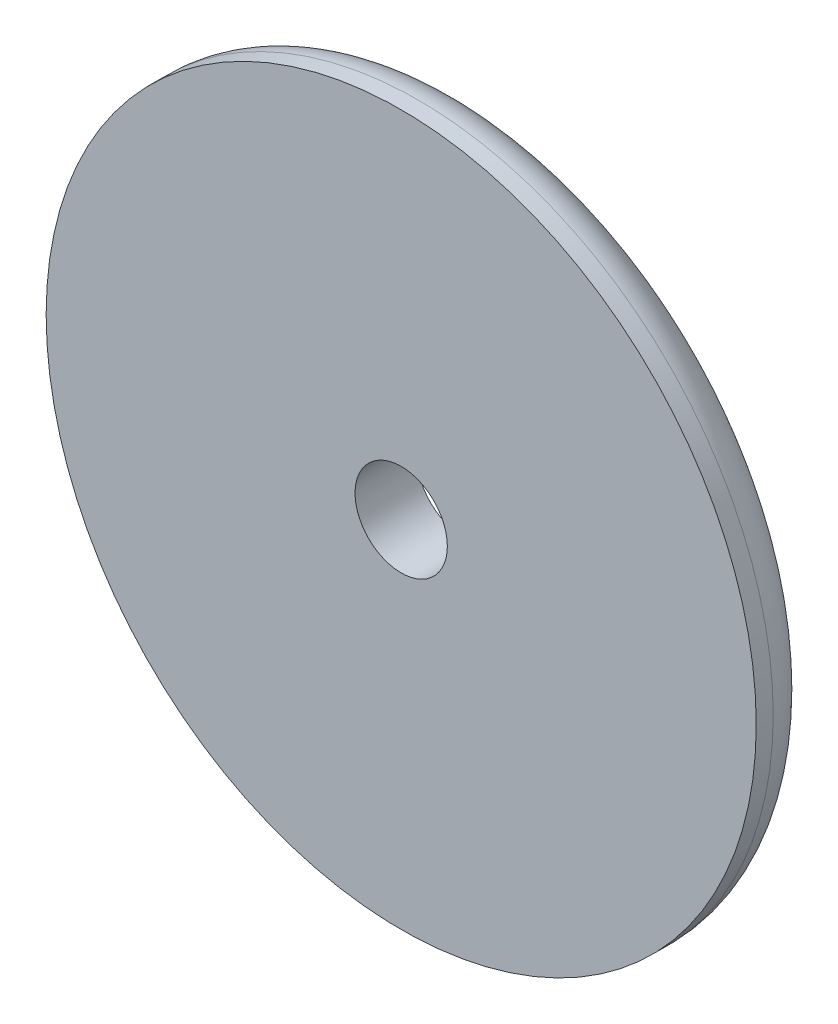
ISO-10303-21;
HEADER;
FILE_DESCRIPTION(('STEP AP214'),'2;1');
FILE_NAME('part.step','',(''),(''),'','','');
FILE_SCHEMA(('AUTOMOTIVE_DESIGN { 1 0 10303 214 1 1 1 1 }'));
ENDSEC;
DATA;
#1=APPLICATION_CONTEXT('core data for automotive mechanical design processes');
#2=APPLICATION_PROTOCOL_DEFINITION('international standard','automotive_design',2000,#1);
#3=PRODUCT_CONTEXT('',#1,'mechanical');
#4=PRODUCT('Part','Part','',(#3));
#5=PRODUCT_RELATED_PRODUCT_CATEGORY('part','',(#4));
#6=PRODUCT_DEFINITION_FORMATION('','',#4);
#7=PRODUCT_DEFINITION_CONTEXT('part definition',#1,'design');
#8=PRODUCT_DEFINITION('design','',#6,#7);
#9=PRODUCT_DEFINITION_SHAPE('','',#8);
#10=(LENGTH_UNIT() NAMED_UNIT(*) SI_UNIT(.MILLI.,.METRE.));
#11=(NAMED_UNIT(*) PLANE_ANGLE_UNIT() SI_UNIT($,.RADIAN.));
#12=(NAMED_UNIT(*) SI_UNIT($,.STERADIAN.) SOLID_ANGLE_UNIT());
#13=UNCERTAINTY_MEASURE_WITH_UNIT(LENGTH_MEASURE(1.E-05),#10,'distance_accuracy_value','');
#14=(GEOMETRIC_REPRESENTATION_CONTEXT(3) GLOBAL_UNCERTAINTY_ASSIGNED_CONTEXT((#13)) GLOBAL_UNIT_ASSIGNED_CONTEXT((#10,
#11,#12)) REPRESENTATION_CONTEXT('',''));
#15=CARTESIAN_POINT('',(0.,0.,0.));
#16=DIRECTION('',(0.,0.,1.));
#17=DIRECTION('',(1.,0.,0.));
#18=AXIS2_PLACEMENT_3D('',#15,#16,#17);
#19=CARTESIAN_POINT('',(0.,0.,0.));
#20=DIRECTION('',(0.,0.,1.));
#21=DIRECTION('',(1.,0.,0.));
#22=AXIS2_PLACEMENT_3D('',#19,#20,#21);
#23=PLANE('',#22);
#24=CARTESIAN_POINT('',(0.,0.,0.));
#25=DIRECTION('',(0.,0.,1.));
#26=DIRECTION('',(1.,0.,0.));
#27=AXIS2_PLACEMENT_3D('',#24,#25,#26);
#28=CIRCLE('',#27,1.6256);
#29=CARTESIAN_POINT('',(1.6256,0.,0.));
#30=VERTEX_POINT('',#29);
#31=EDGE_CURVE('E309',#30,#30,#28,.T.);
#32=ORIENTED_EDGE('',*,*,#31,.T.);
#33=EDGE_LOOP('',(#32));
#34=FACE_BOUND('',#33,.T.);
#35=CARTESIAN_POINT('',(0.,0.,0.));
#36=DIRECTION('',(0.,0.,1.));
#37=DIRECTION('',(1.,0.,0.));
#38=AXIS2_PLACEMENT_3D('',#35,#36,#37);
#39=CIRCLE('',#38,10.922);
#40=CARTESIAN_POINT('',(5.1054,-9.65530811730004,0.));
#41=VERTEX_POINT('',#40);
#42=CARTESIAN_POINT('',(1.5875,-10.8060134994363,0.));
#43=VERTEX_POINT('',#42);
#44=EDGE_CURVE('E322',#41,#43,#39,.F.);
#45=ORIENTED_EDGE('',*,*,#44,.T.);
#46=DIRECTION('',(0.,-1.,0.));
#47=VECTOR('',#46,1.);
#48=CARTESIAN_POINT('',(1.5875,-13.6683526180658,0.));
#49=LINE('',#48,#47);
#50=CARTESIAN_POINT('',(1.5875,-9.525,0.));
#51=VERTEX_POINT('',#50);
#52=EDGE_CURVE('E387',#51,#43,#49,.T.);
#53=ORIENTED_EDGE('',*,*,#52,.F.);
#54=CARTESIAN_POINT('',(0.,-9.525,0.));
#55=DIRECTION('',(0.,0.,-1.));
#56=DIRECTION('',(-1.,0.,0.));
#57=AXIS2_PLACEMENT_3D('',#54,#55,#56);
#58=CIRCLE('',#57,1.5875);
#59=CARTESIAN_POINT('',(-1.5875,-9.525,0.));
#60=VERTEX_POINT('',#59);
#61=EDGE_CURVE('E397',#60,#51,#58,.T.);
#62=ORIENTED_EDGE('',*,*,#61,.F.);
#63=DIRECTION('',(0.,1.,0.));
#64=VECTOR('',#63,1.);
#65=CARTESIAN_POINT('',(-1.5875,-13.6683526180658,0.));
#66=LINE('',#65,#64);
#67=CARTESIAN_POINT('',(-1.5875,-10.8060134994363,0.));
#68=VERTEX_POINT('',#67);
#69=EDGE_CURVE('E383',#68,#60,#66,.T.);
#70=ORIENTED_EDGE('',*,*,#69,.F.);
#71=CARTESIAN_POINT('',(-5.1054,-9.65530811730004,0.));
#72=VERTEX_POINT('',#71);
#73=EDGE_CURVE('E311',#68,#72,#39,.F.);
#74=ORIENTED_EDGE('',*,*,#73,.T.);
#75=DIRECTION('',(0.,-1.,0.));
#76=VECTOR('',#75,1.);
#77=CARTESIAN_POINT('',(-5.1054,-7.493,0.));
#78=LINE('',#77,#76);
#79=CARTESIAN_POINT('',(-5.1054,-7.493,0.));
#80=VERTEX_POINT('',#79);
#81=EDGE_CURVE('E347',#80,#72,#78,.T.);
#82=ORIENTED_EDGE('',*,*,#81,.F.);
#83=CARTESIAN_POINT('',(-5.8674,-7.493,0.));
#84=DIRECTION('',(0.,0.,-1.));
#85=DIRECTION('',(-1.,0.,0.));
#86=AXIS2_PLACEMENT_3D('',#83,#84,#85);
#87=CIRCLE('',#86,0.762000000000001);
#88=CARTESIAN_POINT('',(-6.6294,-7.493,0.));
#89=VERTEX_POINT('',#88);
#90=EDGE_CURVE('E341',#89,#80,#87,.T.);
#91=ORIENTED_EDGE('',*,*,#90,.F.);
#92=DIRECTION('',(0.,1.,0.));
#93=VECTOR('',#92,1.);
#94=CARTESIAN_POINT('',(-6.6294,-7.493,0.));
#95=LINE('',#94,#93);
#96=CARTESIAN_POINT('',(-6.6294,-8.67992739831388,0.));
#97=VERTEX_POINT('',#96);
#98=EDGE_CURVE('E352',#97,#89,#95,.T.);
#99=ORIENTED_EDGE('',*,*,#98,.F.);
#100=CARTESIAN_POINT('',(6.6294,-8.67992739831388,0.));
#101=VERTEX_POINT('',#100);
#102=EDGE_CURVE('E318',#97,#101,#39,.F.);
#103=ORIENTED_EDGE('',*,*,#102,.T.);
#104=DIRECTION('',(0.,1.,0.));
#105=VECTOR('',#104,1.);
#106=CARTESIAN_POINT('',(6.6294,-7.493,0.));
#107=LINE('',#106,#105);
#108=CARTESIAN_POINT('',(6.6294,-7.493,0.));
#109=VERTEX_POINT('',#108);
#110=EDGE_CURVE('E409',#101,#109,#107,.T.);
#111=ORIENTED_EDGE('',*,*,#110,.T.);
#112=CARTESIAN_POINT('',(5.8674,-7.493,0.));
#113=DIRECTION('',(0.,0.,1.));
#114=DIRECTION('',(1.,0.,0.));
#115=AXIS2_PLACEMENT_3D('',#112,#113,#114);
#116=CIRCLE('',#115,0.762000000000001);
#117=CARTESIAN_POINT('',(5.1054,-7.493,0.));
#118=VERTEX_POINT('',#117);
#119=EDGE_CURVE('E197',#109,#118,#116,.T.);
#120=ORIENTED_EDGE('',*,*,#119,.T.);
#121=DIRECTION('',(0.,-1.,0.));
#122=VECTOR('',#121,1.);
#123=CARTESIAN_POINT('',(5.1054,-7.493,0.));
#124=LINE('',#123,#122);
#125=EDGE_CURVE('E169',#118,#41,#124,.T.);
#126=ORIENTED_EDGE('',*,*,#125,.T.);
#127=EDGE_LOOP('',(#45,#53,#62,#70,#74,#82,#91,#99,#103,#111,#120,#126));
#128=FACE_BOUND('',#127,.T.);
#129=ADVANCED_FACE('F35',(#34,#128),#23,.F.);
#130=CARTESIAN_POINT('',(0.,0.,1.5875));
#131=DIRECTION('',(0.,0.,1.));
#132=DIRECTION('',(1.,0.,0.));
#133=AXIS2_PLACEMENT_3D('',#130,#131,#132);
#134=TOROIDAL_SURFACE('',#133,10.922,1.5875);
#135=CARTESIAN_POINT('',(1.5875,-11.9893936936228,0.516758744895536));
#136=CARTESIAN_POINT('',(1.5875,-12.0496408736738,0.582140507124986));
#137=CARTESIAN_POINT('',(1.5875,-12.104438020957,0.65262776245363));
#138=CARTESIAN_POINT('',(1.5875,-12.2014815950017,0.801848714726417));
#139=CARTESIAN_POINT('',(1.5875,-12.2437140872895,0.880591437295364));
#140=CARTESIAN_POINT('',(1.5875,-12.3143254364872,1.04405164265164));
#141=CARTESIAN_POINT('',(1.5875,-12.3427072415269,1.12876784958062));
#142=CARTESIAN_POINT('',(1.5875,-12.3847741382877,1.30175216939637));
#143=CARTESIAN_POINT('',(1.5875,-12.3984627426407,1.39001942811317));
#144=CARTESIAN_POINT('',(1.5875,-12.4107258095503,1.56726399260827));
#145=CARTESIAN_POINT('',(1.5875,-12.4093568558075,1.65623738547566));
#146=CARTESIAN_POINT('',(1.5875,-12.3916813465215,1.83268952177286));
#147=CARTESIAN_POINT('',(1.5875,-12.3753744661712,1.9201682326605));
#148=CARTESIAN_POINT('',(1.5875,-12.3283331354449,2.0910452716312));
#149=CARTESIAN_POINT('',(1.5875,-12.2976154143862,2.17444820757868));
#150=CARTESIAN_POINT('',(1.5875,-12.2226608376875,2.33493803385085));
#151=CARTESIAN_POINT('',(1.5875,-12.178423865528,2.41202486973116));
#152=CARTESIAN_POINT('',(1.5875,-12.0775407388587,2.55799558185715));
#153=CARTESIAN_POINT('',(1.5875,-12.0208518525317,2.62684991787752));
#154=CARTESIAN_POINT('',(1.5875,-11.8967942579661,2.75414792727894));
#155=CARTESIAN_POINT('',(1.5875,-11.8294252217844,2.81259128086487));
#156=CARTESIAN_POINT('',(1.5875,-11.6854074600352,2.91786867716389));
#157=CARTESIAN_POINT('',(1.5875,-11.6086952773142,2.96461589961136));
#158=CARTESIAN_POINT('',(1.5875,-11.4485648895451,3.04469895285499));
#159=CARTESIAN_POINT('',(1.5875,-11.3651463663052,3.07803414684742));
#160=CARTESIAN_POINT('',(1.5875,-11.19317684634,3.13065824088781));
#161=CARTESIAN_POINT('',(1.5875,-11.1045867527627,3.14981938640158));
#162=CARTESIAN_POINT('',(1.5875,-10.9254523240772,3.17311863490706));
#163=CARTESIAN_POINT('',(1.5875,-10.8349078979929,3.17725603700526));
#164=CARTESIAN_POINT('',(1.5875,-10.6537127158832,3.17039582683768));
#165=CARTESIAN_POINT('',(1.5875,-10.5630662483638,3.15928455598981));
#166=CARTESIAN_POINT('',(1.5875,-10.384910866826,3.12204245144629));
#167=CARTESIAN_POINT('',(1.5875,-10.2974020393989,3.09591120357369));
#168=CARTESIAN_POINT('',(1.5875,-10.1277953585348,3.02925967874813));
#169=CARTESIAN_POINT('',(1.5875,-10.0457113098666,2.98870425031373));
#170=CARTESIAN_POINT('',(1.5875,-9.88956216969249,2.89432058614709));
#171=CARTESIAN_POINT('',(1.5875,-9.81549695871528,2.84049254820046));
#172=CARTESIAN_POINT('',(1.5875,-9.6779301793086,2.72135538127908));
#173=CARTESIAN_POINT('',(1.5875,-9.61437587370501,2.65610717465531));
#174=CARTESIAN_POINT('',(1.5875,-9.49928240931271,2.51575501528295));
#175=CARTESIAN_POINT('',(1.5875,-9.44774247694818,2.44065169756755));
#176=CARTESIAN_POINT('',(1.5875,-9.35880933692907,2.28366949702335));
#177=CARTESIAN_POINT('',(1.5875,-9.32125522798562,2.20188178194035));
#178=CARTESIAN_POINT('',(1.5875,-9.26061477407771,2.03310826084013));
#179=CARTESIAN_POINT('',(1.5875,-9.23752724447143,1.94612288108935));
#180=CARTESIAN_POINT('',(1.5875,-9.2067545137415,1.77061892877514));
#181=CARTESIAN_POINT('',(1.5875,-9.19887602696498,1.68213421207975));
#182=CARTESIAN_POINT('',(1.5875,-9.19818398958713,1.50510801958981));
#183=CARTESIAN_POINT('',(1.5875,-9.2053697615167,1.41656654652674));
#184=CARTESIAN_POINT('',(1.5875,-9.2344911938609,1.2424831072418));
#185=CARTESIAN_POINT('',(1.5875,-9.25633994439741,1.15692657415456));
#186=CARTESIAN_POINT('',(1.5875,-9.314023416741,0.990668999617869));
#187=CARTESIAN_POINT('',(1.5875,-9.34985834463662,0.909968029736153));
#188=CARTESIAN_POINT('',(1.5875,-9.43463830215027,0.755268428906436));
#189=CARTESIAN_POINT('',(1.5875,-9.48364605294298,0.681304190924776));
#190=CARTESIAN_POINT('',(1.5875,-9.59324236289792,0.542523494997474));
#191=CARTESIAN_POINT('',(1.5875,-9.65383164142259,0.477707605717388));
#192=CARTESIAN_POINT('',(1.5875,-9.78566054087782,0.358209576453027));
#193=CARTESIAN_POINT('',(1.5875,-9.85702178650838,0.303661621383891));
#194=CARTESIAN_POINT('',(1.5875,-10.0077970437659,0.207145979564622));
#195=CARTESIAN_POINT('',(1.5875,-10.0872116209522,0.165179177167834));
#196=CARTESIAN_POINT('',(1.5875,-10.2528984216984,0.0944958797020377));
#197=CARTESIAN_POINT('',(1.5875,-10.3392432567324,0.0659495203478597));
#198=CARTESIAN_POINT('',(1.5875,-10.5154819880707,0.0236549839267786));
#199=CARTESIAN_POINT('',(1.5875,-10.6053759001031,0.00990687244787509));
#200=CARTESIAN_POINT('',(1.5875,-10.7867655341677,-0.00244651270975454));
#201=CARTESIAN_POINT('',(1.5875,-10.8782677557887,-0.000956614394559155));
#202=CARTESIAN_POINT('',(1.5875,-11.0597461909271,0.0173857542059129));
#203=CARTESIAN_POINT('',(1.5875,-11.1497220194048,0.0342420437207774));
#204=CARTESIAN_POINT('',(1.5875,-11.3254612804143,0.0828610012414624));
#205=CARTESIAN_POINT('',(1.5875,-11.4112283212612,0.114610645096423));
#206=CARTESIAN_POINT('',(1.5875,-11.5760813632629,0.192143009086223));
#207=CARTESIAN_POINT('',(1.5875,-11.6551754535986,0.237908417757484));
#208=CARTESIAN_POINT('',(1.5875,-11.7769674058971,0.322985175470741));
#209=CARTESIAN_POINT('',(1.5875,-11.8223666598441,0.358497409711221));
#210=CARTESIAN_POINT('',(1.5875,-11.9090704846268,0.43421220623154));
#211=CARTESIAN_POINT('',(1.5875,-11.9503750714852,0.474414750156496));
#212=CARTESIAN_POINT('',(1.5875,-11.9893936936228,0.516758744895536));
#213=B_SPLINE_CURVE_WITH_KNOTS('',3,(#135,#136,#137,#138,#139,#140,#141,#142,#143,#144,#145,
#146,#147,#148,#149,#150,#151,#152,#153,#154,#155,#156,#157,#158,#159,#160,#161,#162,#163,#164,
#165,#166,#167,#168,#169,#170,#171,#172,#173,#174,#175,#176,#177,#178,#179,#180,#181,#182,#183,
#184,#185,#186,#187,#188,#189,#190,#191,#192,#193,#194,#195,#196,#197,#198,#199,#200,#201,#202,
#203,#204,#205,#206,#207,#208,#209,#210,#211,#212),.UNSPECIFIED.,.T.,.F.,(4,2,2,2,2,2,2,2,2,2,2,
2,2,2,2,2,2,2,2,2,2,2,2,2,2,2,2,2,2,2,2,2,2,2,2,2,2,2,4),(0.,0.266513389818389,
0.533321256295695,0.800072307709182,1.06675957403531,1.33244501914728,1.59813624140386,
1.86351978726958,2.12890562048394,2.39521682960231,2.66153621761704,2.92977745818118,
3.19803143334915,3.46867473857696,3.73933066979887,4.01201497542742,4.28470680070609,
4.55806777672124,4.8314246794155,5.10336545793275,5.37528872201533,5.64397917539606,
5.9126476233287,6.17787859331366,6.44309763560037,6.70675840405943,6.9704230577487,
7.2353660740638,7.50032555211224,7.76853801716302,8.03676933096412,8.30831505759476,
8.57986198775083,8.85310594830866,9.1264178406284,9.39949116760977,9.67222856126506,
9.8448345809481,10.0174399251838),.UNSPECIFIED.);
#214=CARTESIAN_POINT('',(1.5875,-12.4070805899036,1.524));
#215=VERTEX_POINT('',#214);
#216=EDGE_CURVE('E11',#43,#215,#213,.T.);
#217=ORIENTED_EDGE('',*,*,#216,.F.);
#218=ORIENTED_EDGE('',*,*,#44,.F.);
#219=CARTESIAN_POINT('',(5.1054,-9.870448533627,0.0114888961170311));
#220=CARTESIAN_POINT('',(5.1054,-9.73564119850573,-0.00298907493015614));
#221=CARTESIAN_POINT('',(5.1054,-9.59913551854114,-0.00371368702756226));
#222=CARTESIAN_POINT('',(5.1054,-9.32842805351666,0.0217434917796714));
#223=CARTESIAN_POINT('',(5.1054,-9.19423315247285,0.0479949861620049));
#224=CARTESIAN_POINT('',(5.1054,-8.95403293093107,0.120405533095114));
#225=CARTESIAN_POINT('',(5.1054,-8.84689265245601,0.162826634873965));
#226=CARTESIAN_POINT('',(5.1054,-8.64162951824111,0.265641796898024));
#227=CARTESIAN_POINT('',(5.1054,-8.54349893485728,0.326020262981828));
#228=CARTESIAN_POINT('',(5.1054,-8.36324638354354,0.461593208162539));
#229=CARTESIAN_POINT('',(5.1054,-8.28068935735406,0.536205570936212));
#230=CARTESIAN_POINT('',(5.1054,-8.13184365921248,0.700189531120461));
#231=CARTESIAN_POINT('',(5.1054,-8.06552305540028,0.78953157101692));
#232=CARTESIAN_POINT('',(5.1054,-7.96953538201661,0.953526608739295));
#233=CARTESIAN_POINT('',(5.1054,-7.93480569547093,1.02523704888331));
#234=CARTESIAN_POINT('',(5.1054,-7.87780485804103,1.17345227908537));
#235=CARTESIAN_POINT('',(5.1054,-7.85552367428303,1.24995315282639));
#236=CARTESIAN_POINT('',(5.1054,-7.82465390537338,1.40597357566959));
#237=CARTESIAN_POINT('',(5.1054,-7.81611368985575,1.48550278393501));
#238=CARTESIAN_POINT('',(5.1054,-7.81343744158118,1.64480727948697));
#239=CARTESIAN_POINT('',(5.1054,-7.81930062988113,1.72458255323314));
#240=CARTESIAN_POINT('',(5.1054,-7.84428811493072,1.87725754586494));
#241=CARTESIAN_POINT('',(5.1054,-7.86262716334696,1.95028829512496));
#242=CARTESIAN_POINT('',(5.1054,-7.9107423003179,2.09245647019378));
#243=CARTESIAN_POINT('',(5.1054,-7.94052002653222,2.16159333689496));
#244=CARTESIAN_POINT('',(5.1054,-8.01185941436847,2.2978362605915));
#245=CARTESIAN_POINT('',(5.1054,-8.0539290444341,2.36467476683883));
#246=CARTESIAN_POINT('',(5.1054,-8.14743049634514,2.49142065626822));
#247=CARTESIAN_POINT('',(5.1054,-8.19886624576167,2.55132511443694));
#248=CARTESIAN_POINT('',(5.1054,-8.31687995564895,2.67103723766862));
#249=CARTESIAN_POINT('',(5.1054,-8.38456362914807,2.72975344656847));
#250=CARTESIAN_POINT('',(5.1054,-8.5277062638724,2.83676851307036));
#251=CARTESIAN_POINT('',(5.1054,-8.60316961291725,2.88506144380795));
#252=CARTESIAN_POINT('',(5.1054,-8.77179936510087,2.97728597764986));
#253=CARTESIAN_POINT('',(5.1054,-8.86592225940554,3.01947282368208));
#254=CARTESIAN_POINT('',(5.1054,-9.05948034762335,3.08910238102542));
#255=CARTESIAN_POINT('',(5.1054,-9.15891828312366,3.11653740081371));
#256=CARTESIAN_POINT('',(5.1054,-9.3709335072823,3.15824413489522));
#257=CARTESIAN_POINT('',(5.1054,-9.48382848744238,3.17092003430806));
#258=CARTESIAN_POINT('',(5.1054,-9.71019434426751,3.17740871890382));
#259=CARTESIAN_POINT('',(5.1054,-9.82366535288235,3.17121696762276));
#260=CARTESIAN_POINT('',(5.1054,-10.0492195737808,3.13938814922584));
#261=CARTESIAN_POINT('',(5.1054,-10.1612721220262,3.11352974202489));
#262=CARTESIAN_POINT('',(5.1054,-10.3788990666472,3.04198101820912));
#263=CARTESIAN_POINT('',(5.1054,-10.4844756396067,2.99629740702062));
#264=CARTESIAN_POINT('',(5.1054,-10.6780782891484,2.88940536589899));
#265=CARTESIAN_POINT('',(5.1054,-10.7668124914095,2.82948412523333));
#266=CARTESIAN_POINT('',(5.1054,-10.9314017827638,2.69396859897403));
#267=CARTESIAN_POINT('',(5.1054,-11.0072667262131,2.61838640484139));
#268=CARTESIAN_POINT('',(5.1054,-11.1353053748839,2.4623417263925));
#269=CARTESIAN_POINT('',(5.1054,-11.1891349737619,2.38323770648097));
#270=CARTESIAN_POINT('',(5.1054,-11.2811334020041,2.21639165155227));
#271=CARTESIAN_POINT('',(5.1054,-11.3193130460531,2.12865563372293));
#272=CARTESIAN_POINT('',(5.1054,-11.3753711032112,1.95596533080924));
#273=CARTESIAN_POINT('',(5.1054,-11.3948121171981,1.87151611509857));
#274=CARTESIAN_POINT('',(5.1054,-11.4184185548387,1.7005156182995));
#275=CARTESIAN_POINT('',(5.1054,-11.4225894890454,1.61396510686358));
#276=CARTESIAN_POINT('',(5.1054,-11.4156544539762,1.44579544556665));
#277=CARTESIAN_POINT('',(5.1054,-11.4052947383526,1.36414432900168));
#278=CARTESIAN_POINT('',(5.1054,-11.3710491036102,1.20374140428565));
#279=CARTESIAN_POINT('',(5.1054,-11.3471638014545,1.12498946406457));
#280=CARTESIAN_POINT('',(5.1054,-11.2867006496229,0.972225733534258));
#281=CARTESIAN_POINT('',(5.1054,-11.2500793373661,0.898231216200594));
#282=CARTESIAN_POINT('',(5.1054,-11.1655075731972,0.757050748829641));
#283=CARTESIAN_POINT('',(5.1054,-11.1175558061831,0.689865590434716));
#284=CARTESIAN_POINT('',(5.1054,-11.0092405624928,0.560491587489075));
#285=CARTESIAN_POINT('',(5.1054,-10.9483730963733,0.498725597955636));
#286=CARTESIAN_POINT('',(5.1054,-10.8178279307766,0.385316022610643));
#287=CARTESIAN_POINT('',(5.1054,-10.748144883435,0.333678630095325));
#288=CARTESIAN_POINT('',(5.1054,-10.5957393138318,0.237323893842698));
#289=CARTESIAN_POINT('',(5.1054,-10.5124120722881,0.193565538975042));
#290=CARTESIAN_POINT('',(5.1054,-10.3401591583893,0.119287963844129));
#291=CARTESIAN_POINT('',(5.1054,-10.2512389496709,0.0887560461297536));
#292=CARTESIAN_POINT('',(5.1054,-10.113035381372,0.0523231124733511));
#293=CARTESIAN_POINT('',(5.1054,-10.0649666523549,0.0416091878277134));
#294=CARTESIAN_POINT('',(5.1054,-9.9681562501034,0.0238210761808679));
#295=CARTESIAN_POINT('',(5.1054,-9.91941442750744,0.0167477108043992));
#296=CARTESIAN_POINT('',(5.1054,-9.870448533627,0.0114888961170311));
#297=B_SPLINE_CURVE_WITH_KNOTS('',3,(#219,#220,#221,#222,#223,#224,#225,#226,#227,#228,#229,
#230,#231,#232,#233,#234,#235,#236,#237,#238,#239,#240,#241,#242,#243,#244,#245,#246,#247,#248,
#249,#250,#251,#252,#253,#254,#255,#256,#257,#258,#259,#260,#261,#262,#263,#264,#265,#266,#267,
#268,#269,#270,#271,#272,#273,#274,#275,#276,#277,#278,#279,#280,#281,#282,#283,#284,#285,#286,
#287,#288,#289,#290,#291,#292,#293,#294,#295,#296),.UNSPECIFIED.,.T.,.F.,(4,2,2,2,2,2,2,2,2,2,2,
2,2,2,2,2,2,2,2,2,2,2,2,2,2,2,2,2,2,2,2,2,2,2,2,2,2,2,4),(0.,0.406499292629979,
0.814051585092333,1.15811979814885,1.50189009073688,1.83381663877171,2.16508505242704,
2.40312132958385,2.64096548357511,2.87964505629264,3.11831172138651,3.34319769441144,
3.56811587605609,3.80410714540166,4.04019760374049,4.30796569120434,4.57588563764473,
4.88404993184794,5.19237474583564,5.53161688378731,5.87094059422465,6.21414082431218,
6.55722506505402,6.87666043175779,7.19585008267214,7.4813293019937,7.76661091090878,
8.02525743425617,8.28381060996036,8.52956076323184,8.77529970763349,9.02188561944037,
9.26850016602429,9.52755204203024,9.78676182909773,10.0679665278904,10.3489006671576,
10.4965195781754,10.6441717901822),.UNSPECIFIED.);
#298=CARTESIAN_POINT('',(5.1054,-10.1599999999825,0.0647039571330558));
#299=VERTEX_POINT('',#298);
#300=EDGE_CURVE('E234',#299,#41,#297,.T.);
#301=ORIENTED_EDGE('',*,*,#300,.F.);
#302=CARTESIAN_POINT('',(6.62939997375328,-10.1598,0.559129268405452));
#303=CARTESIAN_POINT('',(6.62939558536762,-10.1910302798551,0.589886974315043));
#304=CARTESIAN_POINT('',(6.62749729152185,-10.2216389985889,0.621230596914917));
#305=CARTESIAN_POINT('',(6.62026626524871,-10.2814382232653,0.684818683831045));
#306=CARTESIAN_POINT('',(6.61493630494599,-10.3106298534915,0.717062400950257));
#307=CARTESIAN_POINT('',(6.60120707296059,-10.3674173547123,0.782168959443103));
#308=CARTESIAN_POINT('',(6.59281358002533,-10.3950161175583,0.815030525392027));
#309=CARTESIAN_POINT('',(6.5732097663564,-10.4486018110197,0.881217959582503));
#310=CARTESIAN_POINT('',(6.56199959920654,-10.4745888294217,0.914543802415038));
#311=CARTESIAN_POINT('',(6.53812945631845,-10.5225078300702,0.978215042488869));
#312=CARTESIAN_POINT('',(6.52571193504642,-10.5445896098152,1.0085394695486));
#313=CARTESIAN_POINT('',(6.49875029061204,-10.5874124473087,1.06911465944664));
#314=CARTESIAN_POINT('',(6.4842095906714,-10.6081555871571,1.09936546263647));
#315=CARTESIAN_POINT('',(6.45842231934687,-10.6412539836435,1.14869090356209));
#316=CARTESIAN_POINT('',(6.44785748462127,-10.6539559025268,1.16789331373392));
#317=CARTESIAN_POINT('',(6.42558246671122,-10.6789977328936,1.20598262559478));
#318=CARTESIAN_POINT('',(6.41386906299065,-10.691336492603,1.22486845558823));
#319=CARTESIAN_POINT('',(6.38891743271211,-10.7158529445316,1.261936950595));
#320=CARTESIAN_POINT('',(6.3756690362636,-10.7280288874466,1.2801137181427));
#321=CARTESIAN_POINT('',(6.34692607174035,-10.7525040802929,1.31465250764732));
#322=CARTESIAN_POINT('',(6.33144087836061,-10.7648026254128,1.33102162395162));
#323=CARTESIAN_POINT('',(6.30685315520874,-10.7825732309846,1.34974676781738));
#324=CARTESIAN_POINT('',(6.29951001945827,-10.7877043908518,1.35461114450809));
#325=CARTESIAN_POINT('',(6.28404436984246,-10.7980728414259,1.36263406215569));
#326=CARTESIAN_POINT('',(6.27592861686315,-10.8033089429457,1.36580603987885));
#327=CARTESIAN_POINT('',(6.26193372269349,-10.8119432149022,1.36901790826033));
#328=CARTESIAN_POINT('',(6.25623096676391,-10.8153616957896,1.369755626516));
#329=CARTESIAN_POINT('',(6.24470883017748,-10.8220622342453,1.37002880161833));
#330=CARTESIAN_POINT('',(6.2388893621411,-10.8253441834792,1.3695633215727));
#331=CARTESIAN_POINT('',(6.22736349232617,-10.8316497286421,1.36751647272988));
#332=CARTESIAN_POINT('',(6.22165662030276,-10.8346747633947,1.36594185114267));
#333=CARTESIAN_POINT('',(6.21042839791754,-10.8404523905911,1.36190188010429));
#334=CARTESIAN_POINT('',(6.20490722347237,-10.8432047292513,1.35943571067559));
#335=CARTESIAN_POINT('',(6.18860573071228,-10.8510990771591,1.35102985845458));
#336=CARTESIAN_POINT('',(6.17815467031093,-10.8558422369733,1.34409993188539));
#337=CARTESIAN_POINT('',(6.1579234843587,-10.8645293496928,1.32887128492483));
#338=CARTESIAN_POINT('',(6.14814742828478,-10.8684686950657,1.32056514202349));
#339=CARTESIAN_POINT('',(6.11915223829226,-10.879514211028,1.29426922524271));
#340=CARTESIAN_POINT('',(6.10062074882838,-10.8856832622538,1.27514690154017));
#341=CARTESIAN_POINT('',(6.06422417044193,-10.8963828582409,1.23582206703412));
#342=CARTESIAN_POINT('',(6.0463610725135,-10.9009088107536,1.21561670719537));
#343=CARTESIAN_POINT('',(6.0108385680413,-10.908599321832,1.17462325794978));
#344=CARTESIAN_POINT('',(5.99318023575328,-10.9117584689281,1.1538331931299));
#345=CARTESIAN_POINT('',(5.9579674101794,-10.9168069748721,1.11206317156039));
#346=CARTESIAN_POINT('',(5.94041282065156,-10.9186977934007,1.09108346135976));
#347=CARTESIAN_POINT('',(5.89015822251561,-10.9223661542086,1.03094532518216));
#348=CARTESIAN_POINT('',(5.85743851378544,-10.9226429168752,0.991695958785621));
#349=CARTESIAN_POINT('',(5.79185568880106,-10.9189564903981,0.913498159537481));
#350=CARTESIAN_POINT('',(5.75899246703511,-10.9149893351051,0.874550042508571));
#351=CARTESIAN_POINT('',(5.66065345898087,-10.896438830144,0.758978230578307));
#352=CARTESIAN_POINT('',(5.59510769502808,-10.875233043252,0.683237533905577));
#353=CARTESIAN_POINT('',(5.4913140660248,-10.8242190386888,0.564645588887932));
#354=CARTESIAN_POINT('',(5.45198859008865,-10.8005530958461,0.520048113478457));
#355=CARTESIAN_POINT('',(5.37615663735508,-10.7444175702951,0.434033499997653));
#356=CARTESIAN_POINT('',(5.33964704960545,-10.7119578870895,0.392612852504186));
#357=CARTESIAN_POINT('',(5.27865071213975,-10.6453983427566,0.322406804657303));
#358=CARTESIAN_POINT('',(5.25324102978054,-10.6130356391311,0.292782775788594));
#359=CARTESIAN_POINT('',(5.20697250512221,-10.542431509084,0.237154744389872));
#360=CARTESIAN_POINT('',(5.18610915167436,-10.5041959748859,0.211147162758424));
#361=CARTESIAN_POINT('',(5.15346295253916,-10.4289640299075,0.167374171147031));
#362=CARTESIAN_POINT('',(5.14076166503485,-10.3927466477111,0.148955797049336));
#363=CARTESIAN_POINT('',(5.12080832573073,-10.3173422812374,0.115642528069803));
#364=CARTESIAN_POINT('',(5.11354474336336,-10.2781617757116,0.10074022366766));
#365=CARTESIAN_POINT('',(5.10808405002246,-10.2252152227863,0.0834577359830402));
#366=CARTESIAN_POINT('',(5.10707863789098,-10.2122222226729,0.0794360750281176));
#367=CARTESIAN_POINT('',(5.10573548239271,-10.1861039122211,0.0717668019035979));
#368=CARTESIAN_POINT('',(5.10539718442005,-10.172978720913,0.068118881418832));
#369=CARTESIAN_POINT('',(5.10540002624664,-10.1598,0.064651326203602));
#370=B_SPLINE_CURVE_WITH_KNOTS('',3,(#302,#303,#304,#305,#306,#307,#308,#309,#310,#311,#312,
#313,#314,#315,#316,#317,#318,#319,#320,#321,#322,#323,#324,#325,#326,#327,#328,#329,#330,#331,
#332,#333,#334,#335,#336,#337,#338,#339,#340,#341,#342,#343,#344,#345,#346,#347,#348,#349,#350,
#351,#352,#353,#354,#355,#356,#357,#358,#359,#360,#361,#362,#363,#364,#365,#366,#367,#368,#369),
.UNSPECIFIED.,.F.,.F.,(4,2,2,2,2,2,2,2,2,2,2,2,2,2,2,2,2,2,2,2,2,2,2,2,2,2,2,2,2,2,2,2,2,4),(0.,
0.131405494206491,0.262704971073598,0.393758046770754,0.524803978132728,0.643270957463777,
0.76154899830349,0.837526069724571,0.91372262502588,0.990456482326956,1.06687759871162,
1.09735645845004,1.12758958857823,1.1475558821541,1.16753772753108,1.1873990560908,
1.20727869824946,1.24726656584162,1.28747757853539,1.36926550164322,1.45128028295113,
1.53361687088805,1.61585853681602,1.76894798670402,1.92218063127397,2.2271476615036,
2.41857155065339,2.60978083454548,2.7613239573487,2.91271601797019,3.03990657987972,
3.16682666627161,3.20772517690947,3.24858967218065),.UNSPECIFIED.);
#371=CARTESIAN_POINT('',(6.6294,-10.16,0.559326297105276));
#372=VERTEX_POINT('',#371);
#373=EDGE_CURVE('E230',#372,#299,#370,.T.);
#374=ORIENTED_EDGE('',*,*,#373,.F.);
#375=CARTESIAN_POINT('',(6.6294,-9.87044045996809,0.329353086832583));
#376=CARTESIAN_POINT('',(6.6294,-9.94852562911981,0.379237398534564));
#377=CARTESIAN_POINT('',(6.6294,-10.022990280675,0.434975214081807));
#378=CARTESIAN_POINT('',(6.6294,-10.1620968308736,0.557838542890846));
#379=CARTESIAN_POINT('',(6.6294,-10.2267234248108,0.624981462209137));
#380=CARTESIAN_POINT('',(6.6294,-10.3436129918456,0.770059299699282));
#381=CARTESIAN_POINT('',(6.6294,-10.39579904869,0.848056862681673));
#382=CARTESIAN_POINT('',(6.6294,-10.4843906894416,1.01253573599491));
#383=CARTESIAN_POINT('',(6.6294,-10.5208138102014,1.099007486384));
#384=CARTESIAN_POINT('',(6.6294,-10.5726181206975,1.26778145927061));
#385=CARTESIAN_POINT('',(6.6294,-10.5898568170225,1.34951450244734));
#386=CARTESIAN_POINT('',(6.6294,-10.609014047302,1.51475127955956));
#387=CARTESIAN_POINT('',(6.6294,-10.6109397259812,1.59825416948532));
#388=CARTESIAN_POINT('',(6.6294,-10.5998499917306,1.75739263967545));
#389=CARTESIAN_POINT('',(6.6294,-10.5880376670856,1.83311547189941));
#390=CARTESIAN_POINT('',(6.6294,-10.5520040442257,1.98152897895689));
#391=CARTESIAN_POINT('',(6.6294,-10.5277834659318,2.05421982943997));
#392=CARTESIAN_POINT('',(6.6294,-10.4676764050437,2.19561162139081));
#393=CARTESIAN_POINT('',(6.6294,-10.4316528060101,2.26425389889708));
#394=CARTESIAN_POINT('',(6.6294,-10.349514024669,2.39518338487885));
#395=CARTESIAN_POINT('',(6.6294,-10.3033959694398,2.45746877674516));
#396=CARTESIAN_POINT('',(6.6294,-10.1980849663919,2.58008994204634));
#397=CARTESIAN_POINT('',(6.6294,-10.1380826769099,2.63972843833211));
#398=CARTESIAN_POINT('',(6.6294,-10.0100589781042,2.74962808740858));
#399=CARTESIAN_POINT('',(6.6294,-9.94203387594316,2.79988489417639));
#400=CARTESIAN_POINT('',(6.6294,-9.78940685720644,2.89744325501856));
#401=CARTESIAN_POINT('',(6.6294,-9.70383736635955,2.94322821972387));
#402=CARTESIAN_POINT('',(6.6294,-9.52709738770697,3.02221684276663));
#403=CARTESIAN_POINT('',(6.6294,-9.43592356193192,3.05541291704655));
#404=CARTESIAN_POINT('',(6.6294,-9.23367973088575,3.11432637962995));
#405=CARTESIAN_POINT('',(6.6294,-9.12192846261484,3.13770511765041));
#406=CARTESIAN_POINT('',(6.6294,-8.89626750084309,3.16829197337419));
#407=CARTESIAN_POINT('',(6.6294,-8.78235686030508,3.17549282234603));
#408=CARTESIAN_POINT('',(6.6294,-8.53567723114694,3.1743688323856));
#409=CARTESIAN_POINT('',(6.6294,-8.40291697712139,3.16326802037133));
#410=CARTESIAN_POINT('',(6.6294,-8.14046942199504,3.12092566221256));
#411=CARTESIAN_POINT('',(6.6294,-8.01078730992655,3.08965230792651));
#412=CARTESIAN_POINT('',(6.6294,-7.74614287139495,3.00356970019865));
#413=CARTESIAN_POINT('',(6.6294,-7.61179156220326,2.94686063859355));
#414=CARTESIAN_POINT('',(6.6294,-7.35584029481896,2.80965158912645));
#415=CARTESIAN_POINT('',(6.6294,-7.2342112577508,2.72920753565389));
#416=CARTESIAN_POINT('',(6.6294,-7.05494182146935,2.58015328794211));
#417=CARTESIAN_POINT('',(6.6294,-6.99088348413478,2.51922565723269));
#418=CARTESIAN_POINT('',(6.6294,-6.87288980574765,2.38824011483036));
#419=CARTESIAN_POINT('',(6.6294,-6.81893726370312,2.31819806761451));
#420=CARTESIAN_POINT('',(6.6294,-6.73358067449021,2.18387312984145));
#421=CARTESIAN_POINT('',(6.6294,-6.69983449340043,2.12108713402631));
#422=CARTESIAN_POINT('',(6.6294,-6.6431177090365,1.99078811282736));
#423=CARTESIAN_POINT('',(6.6294,-6.62013928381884,1.92327855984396));
#424=CARTESIAN_POINT('',(6.6294,-6.58667176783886,1.78466872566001));
#425=CARTESIAN_POINT('',(6.6294,-6.57627158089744,1.71354654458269));
#426=CARTESIAN_POINT('',(6.6294,-6.5692941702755,1.57063340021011));
#427=CARTESIAN_POINT('',(6.6294,-6.5727112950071,1.49884272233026));
#428=CARTESIAN_POINT('',(6.6294,-6.5918518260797,1.36516547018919));
#429=CARTESIAN_POINT('',(6.6294,-6.60615833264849,1.30306816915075));
#430=CARTESIAN_POINT('',(6.6294,-6.64431781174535,1.18190191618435));
#431=CARTESIAN_POINT('',(6.6294,-6.66817476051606,1.12283423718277));
#432=CARTESIAN_POINT('',(6.6294,-6.7331983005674,0.990045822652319));
#433=CARTESIAN_POINT('',(6.6294,-6.77747417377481,0.917849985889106));
#434=CARTESIAN_POINT('',(6.6294,-6.87714099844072,0.781579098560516));
#435=CARTESIAN_POINT('',(6.6294,-6.93255446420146,0.717520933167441));
#436=CARTESIAN_POINT('',(6.6294,-7.07276738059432,0.5767212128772));
#437=CARTESIAN_POINT('',(6.6294,-7.16104468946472,0.503452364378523));
#438=CARTESIAN_POINT('',(6.6294,-7.34808548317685,0.371989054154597));
#439=CARTESIAN_POINT('',(6.6294,-7.44685924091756,0.313809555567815));
#440=CARTESIAN_POINT('',(6.6294,-7.65423574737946,0.210865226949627));
#441=CARTESIAN_POINT('',(6.6294,-7.76302345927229,0.16647538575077));
#442=CARTESIAN_POINT('',(6.6294,-7.98561283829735,0.093046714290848));
#443=CARTESIAN_POINT('',(6.6294,-8.09941473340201,0.0640085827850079));
#444=CARTESIAN_POINT('',(6.6294,-8.35415567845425,0.0170444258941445));
#445=CARTESIAN_POINT('',(6.6294,-8.49577573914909,0.00273154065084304));
#446=CARTESIAN_POINT('',(6.6294,-8.77958507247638,-0.00202265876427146));
#447=CARTESIAN_POINT('',(6.6294,-8.92177463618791,0.00755038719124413));
#448=CARTESIAN_POINT('',(6.6294,-9.17942143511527,0.0483905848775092));
#449=CARTESIAN_POINT('',(6.6294,-9.29547865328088,0.0758932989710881));
#450=CARTESIAN_POINT('',(6.6294,-9.52130209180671,0.149466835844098));
#451=CARTESIAN_POINT('',(6.6294,-9.6310902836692,0.195467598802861));
#452=CARTESIAN_POINT('',(6.6294,-9.78168095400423,0.275220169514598));
#453=CARTESIAN_POINT('',(6.6294,-9.82663054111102,0.301365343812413));
#454=CARTESIAN_POINT('',(6.6294,-9.87044045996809,0.329353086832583));
#455=B_SPLINE_CURVE_WITH_KNOTS('',3,(#375,#376,#377,#378,#379,#380,#381,#382,#383,#384,#385,
#386,#387,#388,#389,#390,#391,#392,#393,#394,#395,#396,#397,#398,#399,#400,#401,#402,#403,#404,
#405,#406,#407,#408,#409,#410,#411,#412,#413,#414,#415,#416,#417,#418,#419,#420,#421,#422,#423,
#424,#425,#426,#427,#428,#429,#430,#431,#432,#433,#434,#435,#436,#437,#438,#439,#440,#441,#442,
#443,#444,#445,#446,#447,#448,#449,#450,#451,#452,#453,#454),.UNSPECIFIED.,.T.,.F.,(4,2,2,2,2,2,
2,2,2,2,2,2,2,2,2,2,2,2,2,2,2,2,2,2,2,2,2,2,2,2,2,2,2,2,2,2,2,2,2,4),(0.,0.27784382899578,
0.556115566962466,0.836065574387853,1.11570332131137,1.36493138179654,1.6140431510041,
1.84288330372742,2.07171018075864,2.30329564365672,2.53494710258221,2.78774982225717,
3.04066936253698,3.33071337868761,3.62093185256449,3.9621396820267,4.30350078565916,
4.7015332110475,5.10019479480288,5.53551537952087,5.96981816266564,6.23421305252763,
6.49815374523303,6.71116113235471,6.92401354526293,7.13836178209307,7.35262235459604,
7.54295570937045,7.7333683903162,7.98604919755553,8.23924602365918,8.58156966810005,
8.92423148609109,9.27552823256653,9.62684096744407,10.0519145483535,10.4772437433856,
10.833690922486,11.1888006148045,11.3446857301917),.UNSPECIFIED.);
#456=EDGE_CURVE('E223',#101,#372,#455,.T.);
#457=ORIENTED_EDGE('',*,*,#456,.F.);
#458=ORIENTED_EDGE('',*,*,#102,.F.);
#459=CARTESIAN_POINT('',(-6.6294,-9.87044045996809,0.329353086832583));
#460=CARTESIAN_POINT('',(-6.6294,-9.94852562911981,0.379237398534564));
#461=CARTESIAN_POINT('',(-6.6294,-10.022990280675,0.434975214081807));
#462=CARTESIAN_POINT('',(-6.6294,-10.1620968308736,0.557838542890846));
#463=CARTESIAN_POINT('',(-6.6294,-10.2267234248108,0.624981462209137));
#464=CARTESIAN_POINT('',(-6.6294,-10.3436129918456,0.770059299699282));
#465=CARTESIAN_POINT('',(-6.6294,-10.39579904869,0.848056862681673));
#466=CARTESIAN_POINT('',(-6.6294,-10.4843906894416,1.01253573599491));
#467=CARTESIAN_POINT('',(-6.6294,-10.5208138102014,1.099007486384));
#468=CARTESIAN_POINT('',(-6.6294,-10.5726181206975,1.26778145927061));
#469=CARTESIAN_POINT('',(-6.6294,-10.5898568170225,1.34951450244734));
#470=CARTESIAN_POINT('',(-6.6294,-10.609014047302,1.51475127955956));
#471=CARTESIAN_POINT('',(-6.6294,-10.6109397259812,1.59825416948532));
#472=CARTESIAN_POINT('',(-6.6294,-10.5998499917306,1.75739263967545));
#473=CARTESIAN_POINT('',(-6.6294,-10.5880376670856,1.83311547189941));
#474=CARTESIAN_POINT('',(-6.6294,-10.5520040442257,1.98152897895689));
#475=CARTESIAN_POINT('',(-6.6294,-10.5277834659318,2.05421982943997));
#476=CARTESIAN_POINT('',(-6.6294,-10.4676764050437,2.19561162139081));
#477=CARTESIAN_POINT('',(-6.6294,-10.4316528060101,2.26425389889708));
#478=CARTESIAN_POINT('',(-6.6294,-10.349514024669,2.39518338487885));
#479=CARTESIAN_POINT('',(-6.6294,-10.3033959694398,2.45746877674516));
#480=CARTESIAN_POINT('',(-6.6294,-10.1980849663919,2.58008994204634));
#481=CARTESIAN_POINT('',(-6.6294,-10.1380826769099,2.63972843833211));
#482=CARTESIAN_POINT('',(-6.6294,-10.0100589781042,2.74962808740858));
#483=CARTESIAN_POINT('',(-6.6294,-9.94203387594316,2.79988489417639));
#484=CARTESIAN_POINT('',(-6.6294,-9.78940685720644,2.89744325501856));
#485=CARTESIAN_POINT('',(-6.6294,-9.70383736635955,2.94322821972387));
#486=CARTESIAN_POINT('',(-6.6294,-9.52709738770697,3.02221684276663));
#487=CARTESIAN_POINT('',(-6.6294,-9.43592356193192,3.05541291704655));
#488=CARTESIAN_POINT('',(-6.6294,-9.23367973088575,3.11432637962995));
#489=CARTESIAN_POINT('',(-6.6294,-9.12192846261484,3.13770511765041));
#490=CARTESIAN_POINT('',(-6.6294,-8.89626750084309,3.16829197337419));
#491=CARTESIAN_POINT('',(-6.6294,-8.78235686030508,3.17549282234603));
#492=CARTESIAN_POINT('',(-6.6294,-8.53567723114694,3.1743688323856));
#493=CARTESIAN_POINT('',(-6.6294,-8.40291697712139,3.16326802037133));
#494=CARTESIAN_POINT('',(-6.6294,-8.14046942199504,3.12092566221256));
#495=CARTESIAN_POINT('',(-6.6294,-8.01078730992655,3.08965230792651));
#496=CARTESIAN_POINT('',(-6.6294,-7.74614287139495,3.00356970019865));
#497=CARTESIAN_POINT('',(-6.6294,-7.61179156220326,2.94686063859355));
#498=CARTESIAN_POINT('',(-6.6294,-7.35584029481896,2.80965158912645));
#499=CARTESIAN_POINT('',(-6.6294,-7.2342112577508,2.72920753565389));
#500=CARTESIAN_POINT('',(-6.6294,-7.05494182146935,2.58015328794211));
#501=CARTESIAN_POINT('',(-6.6294,-6.99088348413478,2.51922565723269));
#502=CARTESIAN_POINT('',(-6.6294,-6.87288980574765,2.38824011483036));
#503=CARTESIAN_POINT('',(-6.6294,-6.81893726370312,2.31819806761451));
#504=CARTESIAN_POINT('',(-6.6294,-6.73358067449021,2.18387312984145));
#505=CARTESIAN_POINT('',(-6.6294,-6.69983449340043,2.12108713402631));
#506=CARTESIAN_POINT('',(-6.6294,-6.6431177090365,1.99078811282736));
#507=CARTESIAN_POINT('',(-6.6294,-6.62013928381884,1.92327855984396));
#508=CARTESIAN_POINT('',(-6.6294,-6.58667176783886,1.78466872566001));
#509=CARTESIAN_POINT('',(-6.6294,-6.57627158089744,1.71354654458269));
#510=CARTESIAN_POINT('',(-6.6294,-6.5692941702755,1.57063340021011));
#511=CARTESIAN_POINT('',(-6.6294,-6.5727112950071,1.49884272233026));
#512=CARTESIAN_POINT('',(-6.6294,-6.5918518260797,1.36516547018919));
#513=CARTESIAN_POINT('',(-6.6294,-6.60615833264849,1.30306816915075));
#514=CARTESIAN_POINT('',(-6.6294,-6.64431781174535,1.18190191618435));
#515=CARTESIAN_POINT('',(-6.6294,-6.66817476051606,1.12283423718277));
#516=CARTESIAN_POINT('',(-6.6294,-6.7331983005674,0.990045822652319));
#517=CARTESIAN_POINT('',(-6.6294,-6.77747417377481,0.917849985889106));
#518=CARTESIAN_POINT('',(-6.6294,-6.87714099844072,0.781579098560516));
#519=CARTESIAN_POINT('',(-6.6294,-6.93255446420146,0.717520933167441));
#520=CARTESIAN_POINT('',(-6.6294,-7.07276738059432,0.5767212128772));
#521=CARTESIAN_POINT('',(-6.6294,-7.16104468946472,0.503452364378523));
#522=CARTESIAN_POINT('',(-6.6294,-7.34808548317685,0.371989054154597));
#523=CARTESIAN_POINT('',(-6.6294,-7.44685924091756,0.313809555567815));
#524=CARTESIAN_POINT('',(-6.6294,-7.65423574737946,0.210865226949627));
#525=CARTESIAN_POINT('',(-6.6294,-7.76302345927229,0.16647538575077));
#526=CARTESIAN_POINT('',(-6.6294,-7.98561283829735,0.093046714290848));
#527=CARTESIAN_POINT('',(-6.6294,-8.09941473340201,0.0640085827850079));
#528=CARTESIAN_POINT('',(-6.6294,-8.35415567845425,0.0170444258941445));
#529=CARTESIAN_POINT('',(-6.6294,-8.49577573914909,0.00273154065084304));
#530=CARTESIAN_POINT('',(-6.6294,-8.77958507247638,-0.00202265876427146));
#531=CARTESIAN_POINT('',(-6.6294,-8.92177463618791,0.00755038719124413));
#532=CARTESIAN_POINT('',(-6.6294,-9.17942143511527,0.0483905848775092));
#533=CARTESIAN_POINT('',(-6.6294,-9.29547865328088,0.0758932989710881));
#534=CARTESIAN_POINT('',(-6.6294,-9.52130209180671,0.149466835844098));
#535=CARTESIAN_POINT('',(-6.6294,-9.6310902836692,0.195467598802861));
#536=CARTESIAN_POINT('',(-6.6294,-9.78168095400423,0.275220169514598));
#537=CARTESIAN_POINT('',(-6.6294,-9.82663054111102,0.301365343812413));
#538=CARTESIAN_POINT('',(-6.6294,-9.87044045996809,0.329353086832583));
#539=B_SPLINE_CURVE_WITH_KNOTS('',3,(#459,#460,#461,#462,#463,#464,#465,#466,#467,#468,#469,
#470,#471,#472,#473,#474,#475,#476,#477,#478,#479,#480,#481,#482,#483,#484,#485,#486,#487,#488,
#489,#490,#491,#492,#493,#494,#495,#496,#497,#498,#499,#500,#501,#502,#503,#504,#505,#506,#507,
#508,#509,#510,#511,#512,#513,#514,#515,#516,#517,#518,#519,#520,#521,#522,#523,#524,#525,#526,
#527,#528,#529,#530,#531,#532,#533,#534,#535,#536,#537,#538),.UNSPECIFIED.,.T.,.F.,(4,2,2,2,2,2,
2,2,2,2,2,2,2,2,2,2,2,2,2,2,2,2,2,2,2,2,2,2,2,2,2,2,2,2,2,2,2,2,2,4),(0.,0.27784382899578,
0.556115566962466,0.836065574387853,1.11570332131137,1.36493138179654,1.6140431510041,
1.84288330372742,2.07171018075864,2.30329564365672,2.53494710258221,2.78774982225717,
3.04066936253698,3.33071337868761,3.62093185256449,3.9621396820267,4.30350078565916,
4.7015332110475,5.10019479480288,5.53551537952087,5.96981816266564,6.23421305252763,
6.49815374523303,6.71116113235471,6.92401354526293,7.13836178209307,7.35262235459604,
7.54295570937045,7.7333683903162,7.98604919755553,8.23924602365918,8.58156966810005,
8.92423148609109,9.27552823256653,9.62684096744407,10.0519145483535,10.4772437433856,
10.833690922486,11.1888006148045,11.3446857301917),.UNSPECIFIED.);
#540=CARTESIAN_POINT('',(-6.6294,-10.16,0.559326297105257));
#541=VERTEX_POINT('',#540);
#542=EDGE_CURVE('E271',#97,#541,#539,.T.);
#543=ORIENTED_EDGE('',*,*,#542,.T.);
#544=CARTESIAN_POINT('',(-6.62939997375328,-10.1598,0.559129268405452));
#545=CARTESIAN_POINT('',(-6.62939558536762,-10.1910302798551,0.589886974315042));
#546=CARTESIAN_POINT('',(-6.62749729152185,-10.2216389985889,0.621230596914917));
#547=CARTESIAN_POINT('',(-6.62026626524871,-10.2814382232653,0.684818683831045));
#548=CARTESIAN_POINT('',(-6.614936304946,-10.3106298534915,0.717062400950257));
#549=CARTESIAN_POINT('',(-6.60120707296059,-10.3674173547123,0.782168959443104));
#550=CARTESIAN_POINT('',(-6.59281358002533,-10.3950161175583,0.815030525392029));
#551=CARTESIAN_POINT('',(-6.5732097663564,-10.4486018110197,0.881217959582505));
#552=CARTESIAN_POINT('',(-6.56199959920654,-10.4745888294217,0.91454380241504));
#553=CARTESIAN_POINT('',(-6.53812945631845,-10.5225078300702,0.978215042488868));
#554=CARTESIAN_POINT('',(-6.52571193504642,-10.5445896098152,1.0085394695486));
#555=CARTESIAN_POINT('',(-6.49875029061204,-10.5874124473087,1.06911465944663));
#556=CARTESIAN_POINT('',(-6.4842095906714,-10.6081555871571,1.09936546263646));
#557=CARTESIAN_POINT('',(-6.45842231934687,-10.6412539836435,1.14869090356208));
#558=CARTESIAN_POINT('',(-6.44785748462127,-10.6539559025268,1.16789331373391));
#559=CARTESIAN_POINT('',(-6.42558246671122,-10.6789977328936,1.20598262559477));
#560=CARTESIAN_POINT('',(-6.41386906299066,-10.691336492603,1.22486845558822));
#561=CARTESIAN_POINT('',(-6.38891743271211,-10.7158529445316,1.26193695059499));
#562=CARTESIAN_POINT('',(-6.3756690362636,-10.7280288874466,1.2801137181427));
#563=CARTESIAN_POINT('',(-6.34692607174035,-10.7525040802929,1.31465250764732));
#564=CARTESIAN_POINT('',(-6.33144087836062,-10.7648026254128,1.33102162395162));
#565=CARTESIAN_POINT('',(-6.30685315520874,-10.7825732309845,1.34974676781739));
#566=CARTESIAN_POINT('',(-6.29951001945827,-10.7877043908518,1.35461114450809));
#567=CARTESIAN_POINT('',(-6.28404436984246,-10.7980728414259,1.36263406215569));
#568=CARTESIAN_POINT('',(-6.27592861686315,-10.8033089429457,1.36580603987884));
#569=CARTESIAN_POINT('',(-6.26193372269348,-10.8119432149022,1.36901790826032));
#570=CARTESIAN_POINT('',(-6.2562309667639,-10.8153616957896,1.369755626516));
#571=CARTESIAN_POINT('',(-6.24470883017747,-10.8220622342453,1.37002880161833));
#572=CARTESIAN_POINT('',(-6.2388893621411,-10.8253441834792,1.3695633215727));
#573=CARTESIAN_POINT('',(-6.22736349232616,-10.8316497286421,1.36751647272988));
#574=CARTESIAN_POINT('',(-6.22165662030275,-10.8346747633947,1.36594185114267));
#575=CARTESIAN_POINT('',(-6.21042839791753,-10.8404523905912,1.36190188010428));
#576=CARTESIAN_POINT('',(-6.20490722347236,-10.8432047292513,1.35943571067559));
#577=CARTESIAN_POINT('',(-6.18860573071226,-10.8510990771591,1.35102985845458));
#578=CARTESIAN_POINT('',(-6.17815467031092,-10.8558422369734,1.34409993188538));
#579=CARTESIAN_POINT('',(-6.15792348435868,-10.8645293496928,1.32887128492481));
#580=CARTESIAN_POINT('',(-6.14814742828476,-10.8684686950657,1.32056514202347));
#581=CARTESIAN_POINT('',(-6.11915223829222,-10.879514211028,1.29426922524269));
#582=CARTESIAN_POINT('',(-6.10062074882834,-10.8856832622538,1.27514690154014));
#583=CARTESIAN_POINT('',(-6.06422417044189,-10.8963828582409,1.23582206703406));
#584=CARTESIAN_POINT('',(-6.04636107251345,-10.9009088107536,1.21561670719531));
#585=CARTESIAN_POINT('',(-6.01083856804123,-10.908599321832,1.1746232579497));
#586=CARTESIAN_POINT('',(-5.99318023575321,-10.9117584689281,1.15383319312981));
#587=CARTESIAN_POINT('',(-5.9579674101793,-10.9168069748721,1.11206317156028));
#588=CARTESIAN_POINT('',(-5.94041282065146,-10.9186977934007,1.09108346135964));
#589=CARTESIAN_POINT('',(-5.89015822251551,-10.9223661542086,1.03094532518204));
#590=CARTESIAN_POINT('',(-5.85743851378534,-10.9226429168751,0.991695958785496));
#591=CARTESIAN_POINT('',(-5.79185568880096,-10.9189564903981,0.913498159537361));
#592=CARTESIAN_POINT('',(-5.75899246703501,-10.9149893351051,0.874550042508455));
#593=CARTESIAN_POINT('',(-5.66065345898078,-10.896438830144,0.758978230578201));
#594=CARTESIAN_POINT('',(-5.59510769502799,-10.875233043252,0.683237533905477));
#595=CARTESIAN_POINT('',(-5.49131406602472,-10.8242190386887,0.564645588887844));
#596=CARTESIAN_POINT('',(-5.45198859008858,-10.800553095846,0.520048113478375));
#597=CARTESIAN_POINT('',(-5.37615663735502,-10.7444175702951,0.434033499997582));
#598=CARTESIAN_POINT('',(-5.3396470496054,-10.7119578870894,0.392612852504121));
#599=CARTESIAN_POINT('',(-5.27865071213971,-10.6453983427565,0.322406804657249));
#600=CARTESIAN_POINT('',(-5.25324102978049,-10.613035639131,0.292782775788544));
#601=CARTESIAN_POINT('',(-5.20697250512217,-10.5424315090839,0.23715474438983));
#602=CARTESIAN_POINT('',(-5.18610915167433,-10.5041959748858,0.211147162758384));
#603=CARTESIAN_POINT('',(-5.15346295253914,-10.4289640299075,0.167374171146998));
#604=CARTESIAN_POINT('',(-5.14076166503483,-10.3927466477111,0.148955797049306));
#605=CARTESIAN_POINT('',(-5.12080832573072,-10.3173422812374,0.115642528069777));
#606=CARTESIAN_POINT('',(-5.11354474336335,-10.2781617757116,0.100740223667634));
#607=CARTESIAN_POINT('',(-5.10808405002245,-10.2252152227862,0.083457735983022));
#608=CARTESIAN_POINT('',(-5.10707863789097,-10.2122222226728,0.079436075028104));
#609=CARTESIAN_POINT('',(-5.10573548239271,-10.1861039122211,0.0717668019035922));
#610=CARTESIAN_POINT('',(-5.10539718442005,-10.172978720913,0.0681188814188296));
#611=CARTESIAN_POINT('',(-5.10540002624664,-10.1598,0.0646513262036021));
#612=B_SPLINE_CURVE_WITH_KNOTS('',3,(#544,#545,#546,#547,#548,#549,#550,#551,#552,#553,#554,
#555,#556,#557,#558,#559,#560,#561,#562,#563,#564,#565,#566,#567,#568,#569,#570,#571,#572,#573,
#574,#575,#576,#577,#578,#579,#580,#581,#582,#583,#584,#585,#586,#587,#588,#589,#590,#591,#592,
#593,#594,#595,#596,#597,#598,#599,#600,#601,#602,#603,#604,#605,#606,#607,#608,#609,#610,#611),
.UNSPECIFIED.,.F.,.F.,(4,2,2,2,2,2,2,2,2,2,2,2,2,2,2,2,2,2,2,2,2,2,2,2,2,2,2,2,2,2,2,2,2,4),(0.,
0.131405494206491,0.262704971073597,0.393758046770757,0.524803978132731,0.643270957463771,
0.761548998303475,0.83752606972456,0.913722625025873,0.990456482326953,1.06687759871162,
1.09735645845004,1.12758958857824,1.14755588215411,1.16753772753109,1.18739905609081,
1.20727869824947,1.24726656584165,1.28747757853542,1.36926550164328,1.45128028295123,
1.53361687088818,1.61585853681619,1.76894798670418,1.92218063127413,2.22714766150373,
2.4185715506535,2.60978083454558,2.76132395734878,2.91271601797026,3.03990657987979,
3.16682666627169,3.20772517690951,3.24858967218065),.UNSPECIFIED.);
#613=CARTESIAN_POINT('',(-5.1054,-10.1599999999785,0.0647039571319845));
#614=VERTEX_POINT('',#613);
#615=EDGE_CURVE('E267',#541,#614,#612,.T.);
#616=ORIENTED_EDGE('',*,*,#615,.T.);
#617=CARTESIAN_POINT('',(-5.1054,-9.870448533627,0.0114888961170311));
#618=CARTESIAN_POINT('',(-5.1054,-9.73564119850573,-0.00298907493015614));
#619=CARTESIAN_POINT('',(-5.1054,-9.59913551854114,-0.00371368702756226));
#620=CARTESIAN_POINT('',(-5.1054,-9.32842805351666,0.0217434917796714));
#621=CARTESIAN_POINT('',(-5.1054,-9.19423315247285,0.0479949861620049));
#622=CARTESIAN_POINT('',(-5.1054,-8.95403293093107,0.120405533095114));
#623=CARTESIAN_POINT('',(-5.1054,-8.84689265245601,0.162826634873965));
#624=CARTESIAN_POINT('',(-5.1054,-8.64162951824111,0.265641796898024));
#625=CARTESIAN_POINT('',(-5.1054,-8.54349893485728,0.326020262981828));
#626=CARTESIAN_POINT('',(-5.1054,-8.36324638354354,0.461593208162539));
#627=CARTESIAN_POINT('',(-5.1054,-8.28068935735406,0.536205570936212));
#628=CARTESIAN_POINT('',(-5.1054,-8.13184365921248,0.700189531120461));
#629=CARTESIAN_POINT('',(-5.1054,-8.06552305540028,0.78953157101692));
#630=CARTESIAN_POINT('',(-5.1054,-7.96953538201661,0.953526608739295));
#631=CARTESIAN_POINT('',(-5.1054,-7.93480569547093,1.02523704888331));
#632=CARTESIAN_POINT('',(-5.1054,-7.87780485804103,1.17345227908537));
#633=CARTESIAN_POINT('',(-5.1054,-7.85552367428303,1.24995315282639));
#634=CARTESIAN_POINT('',(-5.1054,-7.82465390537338,1.40597357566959));
#635=CARTESIAN_POINT('',(-5.1054,-7.81611368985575,1.48550278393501));
#636=CARTESIAN_POINT('',(-5.1054,-7.81343744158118,1.64480727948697));
#637=CARTESIAN_POINT('',(-5.1054,-7.81930062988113,1.72458255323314));
#638=CARTESIAN_POINT('',(-5.1054,-7.84428811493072,1.87725754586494));
#639=CARTESIAN_POINT('',(-5.1054,-7.86262716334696,1.95028829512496));
#640=CARTESIAN_POINT('',(-5.1054,-7.9107423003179,2.09245647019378));
#641=CARTESIAN_POINT('',(-5.1054,-7.94052002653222,2.16159333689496));
#642=CARTESIAN_POINT('',(-5.1054,-8.01185941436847,2.2978362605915));
#643=CARTESIAN_POINT('',(-5.1054,-8.0539290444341,2.36467476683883));
#644=CARTESIAN_POINT('',(-5.1054,-8.14743049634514,2.49142065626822));
#645=CARTESIAN_POINT('',(-5.1054,-8.19886624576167,2.55132511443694));
#646=CARTESIAN_POINT('',(-5.1054,-8.31687995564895,2.67103723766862));
#647=CARTESIAN_POINT('',(-5.1054,-8.38456362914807,2.72975344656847));
#648=CARTESIAN_POINT('',(-5.1054,-8.5277062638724,2.83676851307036));
#649=CARTESIAN_POINT('',(-5.1054,-8.60316961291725,2.88506144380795));
#650=CARTESIAN_POINT('',(-5.1054,-8.77179936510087,2.97728597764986));
#651=CARTESIAN_POINT('',(-5.1054,-8.86592225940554,3.01947282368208));
#652=CARTESIAN_POINT('',(-5.1054,-9.05948034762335,3.08910238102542));
#653=CARTESIAN_POINT('',(-5.1054,-9.15891828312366,3.11653740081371));
#654=CARTESIAN_POINT('',(-5.1054,-9.3709335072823,3.15824413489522));
#655=CARTESIAN_POINT('',(-5.1054,-9.48382848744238,3.17092003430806));
#656=CARTESIAN_POINT('',(-5.1054,-9.71019434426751,3.17740871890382));
#657=CARTESIAN_POINT('',(-5.1054,-9.82366535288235,3.17121696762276));
#658=CARTESIAN_POINT('',(-5.1054,-10.0492195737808,3.13938814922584));
#659=CARTESIAN_POINT('',(-5.1054,-10.1612721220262,3.11352974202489));
#660=CARTESIAN_POINT('',(-5.1054,-10.3788990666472,3.04198101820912));
#661=CARTESIAN_POINT('',(-5.1054,-10.4844756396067,2.99629740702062));
#662=CARTESIAN_POINT('',(-5.1054,-10.6780782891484,2.88940536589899));
#663=CARTESIAN_POINT('',(-5.1054,-10.7668124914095,2.82948412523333));
#664=CARTESIAN_POINT('',(-5.1054,-10.9314017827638,2.69396859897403));
#665=CARTESIAN_POINT('',(-5.1054,-11.0072667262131,2.61838640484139));
#666=CARTESIAN_POINT('',(-5.1054,-11.1353053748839,2.4623417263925));
#667=CARTESIAN_POINT('',(-5.1054,-11.1891349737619,2.38323770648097));
#668=CARTESIAN_POINT('',(-5.1054,-11.2811334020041,2.21639165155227));
#669=CARTESIAN_POINT('',(-5.1054,-11.3193130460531,2.12865563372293));
#670=CARTESIAN_POINT('',(-5.1054,-11.3753711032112,1.95596533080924));
#671=CARTESIAN_POINT('',(-5.1054,-11.3948121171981,1.87151611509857));
#672=CARTESIAN_POINT('',(-5.1054,-11.4184185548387,1.7005156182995));
#673=CARTESIAN_POINT('',(-5.1054,-11.4225894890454,1.61396510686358));
#674=CARTESIAN_POINT('',(-5.1054,-11.4156544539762,1.44579544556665));
#675=CARTESIAN_POINT('',(-5.1054,-11.4052947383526,1.36414432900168));
#676=CARTESIAN_POINT('',(-5.1054,-11.3710491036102,1.20374140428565));
#677=CARTESIAN_POINT('',(-5.1054,-11.3471638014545,1.12498946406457));
#678=CARTESIAN_POINT('',(-5.1054,-11.2867006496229,0.972225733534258));
#679=CARTESIAN_POINT('',(-5.1054,-11.2500793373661,0.898231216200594));
#680=CARTESIAN_POINT('',(-5.1054,-11.1655075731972,0.757050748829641));
#681=CARTESIAN_POINT('',(-5.1054,-11.1175558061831,0.689865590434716));
#682=CARTESIAN_POINT('',(-5.1054,-11.0092405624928,0.560491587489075));
#683=CARTESIAN_POINT('',(-5.1054,-10.9483730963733,0.498725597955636));
#684=CARTESIAN_POINT('',(-5.1054,-10.8178279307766,0.385316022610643));
#685=CARTESIAN_POINT('',(-5.1054,-10.748144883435,0.333678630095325));
#686=CARTESIAN_POINT('',(-5.1054,-10.5957393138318,0.237323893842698));
#687=CARTESIAN_POINT('',(-5.1054,-10.5124120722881,0.193565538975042));
#688=CARTESIAN_POINT('',(-5.1054,-10.3401591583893,0.119287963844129));
#689=CARTESIAN_POINT('',(-5.1054,-10.2512389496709,0.0887560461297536));
#690=CARTESIAN_POINT('',(-5.1054,-10.113035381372,0.0523231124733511));
#691=CARTESIAN_POINT('',(-5.1054,-10.0649666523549,0.0416091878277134));
#692=CARTESIAN_POINT('',(-5.1054,-9.9681562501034,0.0238210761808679));
#693=CARTESIAN_POINT('',(-5.1054,-9.91941442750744,0.0167477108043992));
#694=CARTESIAN_POINT('',(-5.1054,-9.870448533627,0.0114888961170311));
#695=B_SPLINE_CURVE_WITH_KNOTS('',3,(#617,#618,#619,#620,#621,#622,#623,#624,#625,#626,#627,
#628,#629,#630,#631,#632,#633,#634,#635,#636,#637,#638,#639,#640,#641,#642,#643,#644,#645,#646,
#647,#648,#649,#650,#651,#652,#653,#654,#655,#656,#657,#658,#659,#660,#661,#662,#663,#664,#665,
#666,#667,#668,#669,#670,#671,#672,#673,#674,#675,#676,#677,#678,#679,#680,#681,#682,#683,#684,
#685,#686,#687,#688,#689,#690,#691,#692,#693,#694),.UNSPECIFIED.,.T.,.F.,(4,2,2,2,2,2,2,2,2,2,2,
2,2,2,2,2,2,2,2,2,2,2,2,2,2,2,2,2,2,2,2,2,2,2,2,2,2,2,4),(0.,0.406499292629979,
0.814051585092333,1.15811979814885,1.50189009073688,1.83381663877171,2.16508505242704,
2.40312132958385,2.64096548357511,2.87964505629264,3.11831172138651,3.34319769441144,
3.56811587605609,3.80410714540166,4.04019760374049,4.30796569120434,4.57588563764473,
4.88404993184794,5.19237474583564,5.53161688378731,5.87094059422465,6.21414082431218,
6.55722506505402,6.87666043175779,7.19585008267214,7.4813293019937,7.76661091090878,
8.02525743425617,8.28381060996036,8.52956076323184,8.77529970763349,9.02188561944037,
9.26850016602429,9.52755204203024,9.78676182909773,10.0679665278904,10.3489006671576,
10.4965195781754,10.6441717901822),.UNSPECIFIED.);
#696=EDGE_CURVE('E260',#614,#72,#695,.T.);
#697=ORIENTED_EDGE('',*,*,#696,.T.);
#698=ORIENTED_EDGE('',*,*,#73,.F.);
#699=CARTESIAN_POINT('',(-1.5875,-11.9893936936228,0.516758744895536));
#700=CARTESIAN_POINT('',(-1.5875,-11.9284002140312,0.450578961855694));
#701=CARTESIAN_POINT('',(-1.5875,-11.8617322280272,0.38953464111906));
#702=CARTESIAN_POINT('',(-1.5875,-11.7190157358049,0.279484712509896));
#703=CARTESIAN_POINT('',(-1.5875,-11.6429550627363,0.230494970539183));
#704=CARTESIAN_POINT('',(-1.5875,-11.4837632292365,0.145988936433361));
#705=CARTESIAN_POINT('',(-1.5875,-11.4006382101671,0.110461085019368));
#706=CARTESIAN_POINT('',(-1.5875,-11.2296544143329,0.0537750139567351));
#707=CARTESIAN_POINT('',(-1.5875,-11.1417968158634,0.03261323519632));
#708=CARTESIAN_POINT('',(-1.5875,-10.9632049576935,0.00509123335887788));
#709=CARTESIAN_POINT('',(-1.5875,-10.8724556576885,-0.00117141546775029));
#710=CARTESIAN_POINT('',(-1.5875,-10.6911792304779,0.00153241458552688));
#711=CARTESIAN_POINT('',(-1.5875,-10.6006521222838,0.0105001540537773));
#712=CARTESIAN_POINT('',(-1.5875,-10.4218462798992,0.0435024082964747));
#713=CARTESIAN_POINT('',(-1.5875,-10.3335834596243,0.0676232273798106));
#714=CARTESIAN_POINT('',(-1.5875,-10.1623606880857,0.130347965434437));
#715=CARTESIAN_POINT('',(-1.5875,-10.0794007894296,0.168952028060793));
#716=CARTESIAN_POINT('',(-1.5875,-9.92122370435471,0.259562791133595));
#717=CARTESIAN_POINT('',(-1.5875,-9.84600144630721,0.31156063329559));
#718=CARTESIAN_POINT('',(-1.5875,-9.70544766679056,0.427546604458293));
#719=CARTESIAN_POINT('',(-1.5875,-9.64011575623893,0.49153426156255));
#720=CARTESIAN_POINT('',(-1.5875,-9.52181802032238,0.629127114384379));
#721=CARTESIAN_POINT('',(-1.5875,-9.4687521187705,0.702646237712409));
#722=CARTESIAN_POINT('',(-1.5875,-9.37591097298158,0.857646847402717));
#723=CARTESIAN_POINT('',(-1.5875,-9.33613470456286,0.939127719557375));
#724=CARTESIAN_POINT('',(-1.5875,-9.27155813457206,1.10658305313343));
#725=CARTESIAN_POINT('',(-1.5875,-9.2465666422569,1.19248379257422));
#726=CARTESIAN_POINT('',(-1.5875,-9.21153510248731,1.3672805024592));
#727=CARTESIAN_POINT('',(-1.5875,-9.20149397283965,1.45617625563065));
#728=CARTESIAN_POINT('',(-1.5875,-9.19670763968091,1.63342480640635));
#729=CARTESIAN_POINT('',(-1.5875,-9.20180025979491,1.72177326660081));
#730=CARTESIAN_POINT('',(-1.5875,-9.22676946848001,1.89635309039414));
#731=CARTESIAN_POINT('',(-1.5875,-9.24664577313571,1.98258449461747));
#732=CARTESIAN_POINT('',(-1.5875,-9.30052837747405,2.15038407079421));
#733=CARTESIAN_POINT('',(-1.5875,-9.33451617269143,2.2319581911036));
#734=CARTESIAN_POINT('',(-1.5875,-9.41558831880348,2.38831277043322));
#735=CARTESIAN_POINT('',(-1.5875,-9.46267317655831,2.46309296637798));
#736=CARTESIAN_POINT('',(-1.5875,-9.5690197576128,2.60446162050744));
#737=CARTESIAN_POINT('',(-1.5875,-9.62838516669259,2.67097205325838));
#738=CARTESIAN_POINT('',(-1.5875,-9.75730813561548,2.79324447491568));
#739=CARTESIAN_POINT('',(-1.5875,-9.82686639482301,2.8490057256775));
#740=CARTESIAN_POINT('',(-1.5875,-9.97519040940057,2.94897367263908));
#741=CARTESIAN_POINT('',(-1.5875,-10.054065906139,2.99301756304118));
#742=CARTESIAN_POINT('',(-1.5875,-10.2180362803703,3.06739512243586));
#743=CARTESIAN_POINT('',(-1.5875,-10.3031315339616,3.09772796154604));
#744=CARTESIAN_POINT('',(-1.5875,-10.4780687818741,3.14411175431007));
#745=CARTESIAN_POINT('',(-1.5875,-10.5679505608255,3.16001277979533));
#746=CARTESIAN_POINT('',(-1.5875,-10.7491092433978,3.17655049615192));
#747=CARTESIAN_POINT('',(-1.5875,-10.8403861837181,3.17718678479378));
#748=CARTESIAN_POINT('',(-1.5875,-11.0220295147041,3.16313155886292));
#749=CARTESIAN_POINT('',(-1.5875,-11.1123923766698,3.14839431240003));
#750=CARTESIAN_POINT('',(-1.5875,-11.28934155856,3.10389475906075));
#751=CARTESIAN_POINT('',(-1.5875,-11.3759279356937,3.07413267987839));
#752=CARTESIAN_POINT('',(-1.5875,-11.5424667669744,3.00053418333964));
#753=CARTESIAN_POINT('',(-1.5875,-11.6224454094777,2.95675704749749));
#754=CARTESIAN_POINT('',(-1.5875,-11.7738352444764,2.85628956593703));
#755=CARTESIAN_POINT('',(-1.5875,-11.8452467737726,2.79959972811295));
#756=CARTESIAN_POINT('',(-1.5875,-11.9768367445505,2.67541558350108));
#757=CARTESIAN_POINT('',(-1.5875,-12.0371035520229,2.60801491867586));
#758=CARTESIAN_POINT('',(-1.5875,-12.1453458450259,2.46397567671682));
#759=CARTESIAN_POINT('',(-1.5875,-12.193321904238,2.38733753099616));
#760=CARTESIAN_POINT('',(-1.5875,-12.2751857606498,2.22771982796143));
#761=CARTESIAN_POINT('',(-1.5875,-12.3091927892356,2.14480141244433));
#762=CARTESIAN_POINT('',(-1.5875,-12.3627025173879,1.97441335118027));
#763=CARTESIAN_POINT('',(-1.5875,-12.3822063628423,1.88694406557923));
#764=CARTESIAN_POINT('',(-1.5875,-12.4060528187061,1.71053066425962));
#765=CARTESIAN_POINT('',(-1.5875,-12.4104909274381,1.62159944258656));
#766=CARTESIAN_POINT('',(-1.5875,-12.4043394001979,1.44423461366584));
#767=CARTESIAN_POINT('',(-1.5875,-12.3937462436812,1.35580112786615));
#768=CARTESIAN_POINT('',(-1.5875,-12.3578757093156,1.18211924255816));
#769=CARTESIAN_POINT('',(-1.5875,-12.3326212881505,1.09686608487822));
#770=CARTESIAN_POINT('',(-1.5875,-12.2682035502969,0.931871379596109));
#771=CARTESIAN_POINT('',(-1.5875,-12.2290571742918,0.852123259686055));
#772=CARTESIAN_POINT('',(-1.5875,-12.1557434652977,0.729826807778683));
#773=CARTESIAN_POINT('',(-1.5875,-12.1255402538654,0.684853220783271));
#774=CARTESIAN_POINT('',(-1.5875,-12.0607067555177,0.59822016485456));
#775=CARTESIAN_POINT('',(-1.5875,-12.026076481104,0.556560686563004));
#776=CARTESIAN_POINT('',(-1.5875,-11.9893936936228,0.516758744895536));
#777=B_SPLINE_CURVE_WITH_KNOTS('',3,(#699,#700,#701,#702,#703,#704,#705,#706,#707,#708,#709,
#710,#711,#712,#713,#714,#715,#716,#717,#718,#719,#720,#721,#722,#723,#724,#725,#726,#727,#728,
#729,#730,#731,#732,#733,#734,#735,#736,#737,#738,#739,#740,#741,#742,#743,#744,#745,#746,#747,
#748,#749,#750,#751,#752,#753,#754,#755,#756,#757,#758,#759,#760,#761,#762,#763,#764,#765,#766,
#767,#768,#769,#770,#771,#772,#773,#774,#775,#776),.UNSPECIFIED.,.T.,.F.,(4,2,2,2,2,2,2,2,2,2,2,
2,2,2,2,2,2,2,2,2,2,2,2,2,2,2,2,2,2,2,2,2,2,2,2,2,2,2,4),(0.,0.269799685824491,
0.539952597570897,0.809873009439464,1.07972652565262,1.35134250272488,1.62298096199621,
1.89618074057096,2.16938322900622,2.44240549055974,2.71541700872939,2.98611557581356,
3.25679327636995,3.52388950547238,3.79096639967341,4.05519159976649,4.31941172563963,
4.58328646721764,4.84717142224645,5.11338264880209,5.37961214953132,5.64936752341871,
5.91913922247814,6.19168245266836,6.46423286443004,6.73759635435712,7.01095570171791,
7.28317372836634,7.55538104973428,7.82532767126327,8.09526169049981,8.36284127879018,
8.63039972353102,8.89625897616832,9.16218050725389,9.42768677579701,9.69287037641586,
9.85513415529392,10.0173974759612),.UNSPECIFIED.);
#778=CARTESIAN_POINT('',(-1.5875,-12.4070805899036,1.524));
#779=VERTEX_POINT('',#778);
#780=EDGE_CURVE('E47',#779,#68,#777,.T.);
#781=ORIENTED_EDGE('',*,*,#780,.F.);
#782=CARTESIAN_POINT('',(0.,0.,1.524));
#783=DIRECTION('',(0.,0.,-1.));
#784=DIRECTION('',(-1.,0.,0.));
#785=AXIS2_PLACEMENT_3D('',#782,#783,#784);
#786=CIRCLE('',#785,12.5082294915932);
#787=EDGE_CURVE('E85',#779,#215,#786,.F.);
#788=ORIENTED_EDGE('',*,*,#787,.T.);
#789=EDGE_LOOP('',(#217,#218,#301,#374,#457,#458,#543,#616,#697,#698,#781,#788));
#790=FACE_BOUND('',#789,.T.);
#791=CARTESIAN_POINT('',(0.,0.,1.5875));
#792=DIRECTION('',(0.,0.,1.));
#793=DIRECTION('',(1.,0.,0.));
#794=AXIS2_PLACEMENT_3D('',#791,#792,#793);
#795=CIRCLE('',#794,12.5095);
#796=CARTESIAN_POINT('',(12.5095,0.,1.5875));
#797=VERTEX_POINT('',#796);
#798=EDGE_CURVE('E304',#797,#797,#795,.T.);
#799=ORIENTED_EDGE('',*,*,#798,.F.);
#800=EDGE_LOOP('',(#799));
#801=FACE_BOUND('',#800,.T.);
#802=ADVANCED_FACE('F202',(#790,#801),#134,.T.);
#803=CARTESIAN_POINT('',(0.,0.,2.1844));
#804=DIRECTION('',(0.,0.,-1.));
#805=DIRECTION('',(-1.,0.,0.));
#806=AXIS2_PLACEMENT_3D('',#803,#804,#805);
#807=CYLINDRICAL_SURFACE('',#806,12.5095);
#808=ORIENTED_EDGE('',*,*,#798,.T.);
#809=EDGE_LOOP('',(#808));
#810=FACE_BOUND('',#809,.T.);
#811=CARTESIAN_POINT('',(0.,0.,2.1844));
#812=DIRECTION('',(0.,0.,1.));
#813=DIRECTION('',(1.,0.,0.));
#814=AXIS2_PLACEMENT_3D('',#811,#812,#813);
#815=CIRCLE('',#814,12.5095);
#816=CARTESIAN_POINT('',(12.5095,0.,2.1844));
#817=VERTEX_POINT('',#816);
#818=EDGE_CURVE('E307',#817,#817,#815,.T.);
#819=ORIENTED_EDGE('',*,*,#818,.F.);
#820=EDGE_LOOP('',(#819));
#821=FACE_BOUND('',#820,.T.);
#822=ADVANCED_FACE('F291',(#810,#821),#807,.T.);
#823=CARTESIAN_POINT('',(0.,0.,2.1844));
#824=DIRECTION('',(0.,0.,1.));
#825=DIRECTION('',(1.,0.,0.));
#826=AXIS2_PLACEMENT_3D('',#823,#824,#825);
#827=PLANE('',#826);
#828=CARTESIAN_POINT('',(0.,0.,2.1844));
#829=DIRECTION('',(0.,0.,1.));
#830=DIRECTION('',(1.,0.,0.));
#831=AXIS2_PLACEMENT_3D('',#828,#829,#830);
#832=CIRCLE('',#831,1.6256);
#833=CARTESIAN_POINT('',(1.6256,0.,2.1844));
#834=VERTEX_POINT('',#833);
#835=EDGE_CURVE('E314',#834,#834,#832,.T.);
#836=ORIENTED_EDGE('',*,*,#835,.F.);
#837=EDGE_LOOP('',(#836));
#838=FACE_BOUND('',#837,.T.);
#839=ORIENTED_EDGE('',*,*,#818,.T.);
#840=EDGE_LOOP('',(#839));
#841=FACE_BOUND('',#840,.T.);
#842=ADVANCED_FACE('F287',(#838,#841),#827,.T.);
#843=CARTESIAN_POINT('',(0.,0.,0.));
#844=DIRECTION('',(0.,0.,1.));
#845=DIRECTION('',(1.,0.,0.));
#846=AXIS2_PLACEMENT_3D('',#843,#844,#845);
#847=CYLINDRICAL_SURFACE('',#846,1.6256);
#848=ORIENTED_EDGE('',*,*,#31,.F.);
#849=EDGE_LOOP('',(#848));
#850=FACE_BOUND('',#849,.T.);
#851=ORIENTED_EDGE('',*,*,#835,.T.);
#852=EDGE_LOOP('',(#851));
#853=FACE_BOUND('',#852,.T.);
#854=ADVANCED_FACE('F283',(#850,#853),#847,.F.);
#855=CARTESIAN_POINT('',(-5.1054,-7.493,12.7765029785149));
#856=DIRECTION('',(1.,0.,0.));
#857=DIRECTION('',(0.,1.,0.));
#858=AXIS2_PLACEMENT_3D('',#855,#856,#857);
#859=PLANE('',#858);
#860=DIRECTION('',(0.,0.,-1.));
#861=VECTOR('',#860,1.);
#862=CARTESIAN_POINT('',(-5.1054,-10.16,12.7765029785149));
#863=LINE('',#862,#861);
#864=CARTESIAN_POINT('',(-5.1054,-10.16,-0.203199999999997));
#865=VERTEX_POINT('',#864);
#866=EDGE_CURVE('E361',#614,#865,#863,.T.);
#867=ORIENTED_EDGE('',*,*,#866,.T.);
#868=DIRECTION('',(0.,-1.,0.));
#869=VECTOR('',#868,1.);
#870=CARTESIAN_POINT('',(-5.1054,-7.493,-0.203200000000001));
#871=LINE('',#870,#869);
#872=CARTESIAN_POINT('',(-5.1054,-7.493,-0.2032));
#873=VERTEX_POINT('',#872);
#874=EDGE_CURVE('E321',#865,#873,#871,.F.);
#875=ORIENTED_EDGE('',*,*,#874,.T.);
#876=DIRECTION('',(0.,0.,1.));
#877=VECTOR('',#876,1.);
#878=CARTESIAN_POINT('',(-5.1054,-7.493,-0.9652));
#879=LINE('',#878,#877);
#880=EDGE_CURVE('E360',#873,#80,#879,.T.);
#881=ORIENTED_EDGE('',*,*,#880,.T.);
#882=ORIENTED_EDGE('',*,*,#81,.T.);
#883=ORIENTED_EDGE('',*,*,#696,.F.);
#884=EDGE_LOOP('',(#867,#875,#881,#882,#883));
#885=FACE_BOUND('',#884,.T.);
#886=ADVANCED_FACE('F278',(#885),#859,.T.);
#887=CARTESIAN_POINT('',(-5.8674,-10.16,12.7765029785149));
#888=DIRECTION('',(0.,0.,-1.));
#889=DIRECTION('',(-1.,0.,0.));
#890=AXIS2_PLACEMENT_3D('',#887,#888,#889);
#891=CYLINDRICAL_SURFACE('',#890,0.762);
#892=DIRECTION('',(0.,0.,-1.));
#893=VECTOR('',#892,1.);
#894=CARTESIAN_POINT('',(-6.6294,-10.16,12.7765029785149));
#895=LINE('',#894,#893);
#896=CARTESIAN_POINT('',(-6.6294,-10.16,-0.203199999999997));
#897=VERTEX_POINT('',#896);
#898=EDGE_CURVE('E364',#541,#897,#895,.T.);
#899=ORIENTED_EDGE('',*,*,#898,.T.);
#900=CARTESIAN_POINT('',(-5.8674,-10.16,-0.203200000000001));
#901=DIRECTION('',(0.,0.,-1.));
#902=DIRECTION('',(-1.,0.,0.));
#903=AXIS2_PLACEMENT_3D('',#900,#901,#902);
#904=CIRCLE('',#903,0.762);
#905=EDGE_CURVE('E182',#897,#865,#904,.F.);
#906=ORIENTED_EDGE('',*,*,#905,.T.);
#907=ORIENTED_EDGE('',*,*,#866,.F.);
#908=ORIENTED_EDGE('',*,*,#615,.F.);
#909=EDGE_LOOP('',(#899,#906,#907,#908));
#910=FACE_BOUND('',#909,.T.);
#911=ADVANCED_FACE('F275',(#910),#891,.T.);
#912=CARTESIAN_POINT('',(-6.6294,-7.493,12.7765029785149));
#913=DIRECTION('',(-1.,0.,0.));
#914=DIRECTION('',(0.,0.,1.));
#915=AXIS2_PLACEMENT_3D('',#912,#913,#914);
#916=PLANE('',#915);
#917=DIRECTION('',(0.,0.,1.));
#918=VECTOR('',#917,1.);
#919=CARTESIAN_POINT('',(-6.6294,-7.493,-0.9652));
#920=LINE('',#919,#918);
#921=CARTESIAN_POINT('',(-6.6294,-7.493,-0.2032));
#922=VERTEX_POINT('',#921);
#923=EDGE_CURVE('E359',#922,#89,#920,.T.);
#924=ORIENTED_EDGE('',*,*,#923,.F.);
#925=DIRECTION('',(0.,1.,0.));
#926=VECTOR('',#925,1.);
#927=CARTESIAN_POINT('',(-6.6294,-7.493,-0.203200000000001));
#928=LINE('',#927,#926);
#929=EDGE_CURVE('E184',#922,#897,#928,.F.);
#930=ORIENTED_EDGE('',*,*,#929,.T.);
#931=ORIENTED_EDGE('',*,*,#898,.F.);
#932=ORIENTED_EDGE('',*,*,#542,.F.);
#933=ORIENTED_EDGE('',*,*,#98,.T.);
#934=EDGE_LOOP('',(#924,#930,#931,#932,#933));
#935=FACE_BOUND('',#934,.T.);
#936=ADVANCED_FACE('F251',(#935),#916,.T.);
#937=CARTESIAN_POINT('',(-5.8674,-7.493,-0.9652));
#938=DIRECTION('',(0.,0.,1.));
#939=DIRECTION('',(1.,0.,0.));
#940=AXIS2_PLACEMENT_3D('',#937,#938,#939);
#941=CYLINDRICAL_SURFACE('',#940,0.762000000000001);
#942=ORIENTED_EDGE('',*,*,#880,.F.);
#943=CARTESIAN_POINT('',(-5.8674,-7.493,-0.2032));
#944=DIRECTION('',(0.,0.,1.));
#945=DIRECTION('',(1.,0.,0.));
#946=AXIS2_PLACEMENT_3D('',#943,#944,#945);
#947=CIRCLE('',#946,0.762000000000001);
#948=EDGE_CURVE('E325',#873,#922,#947,.T.);
#949=ORIENTED_EDGE('',*,*,#948,.T.);
#950=ORIENTED_EDGE('',*,*,#923,.T.);
#951=ORIENTED_EDGE('',*,*,#90,.T.);
#952=EDGE_LOOP('',(#942,#949,#950,#951));
#953=FACE_BOUND('',#952,.T.);
#954=ADVANCED_FACE('F247',(#953),#941,.T.);
#955=CARTESIAN_POINT('',(-5.8674,-7.493,-0.2032));
#956=DIRECTION('',(0.,0.,1.));
#957=DIRECTION('',(1.,0.,0.));
#958=AXIS2_PLACEMENT_3D('',#955,#956,#957);
#959=SPHERICAL_SURFACE('',#958,0.762);
#960=CARTESIAN_POINT('',(-5.8674,-7.493,-0.2032));
#961=DIRECTION('',(0.,-1.,0.));
#962=DIRECTION('',(0.,0.,-1.));
#963=AXIS2_PLACEMENT_3D('',#960,#961,#962);
#964=CIRCLE('',#963,0.762);
#965=CARTESIAN_POINT('',(-5.8674,-7.493,-0.9652));
#966=VERTEX_POINT('',#965);
#967=EDGE_CURVE('E187',#922,#966,#964,.T.);
#968=ORIENTED_EDGE('',*,*,#967,.F.);
#969=ORIENTED_EDGE('',*,*,#948,.F.);
#970=CARTESIAN_POINT('',(-5.8674,-7.493,-0.2032));
#971=DIRECTION('',(0.,-1.,0.));
#972=DIRECTION('',(0.,0.,-1.));
#973=AXIS2_PLACEMENT_3D('',#970,#971,#972);
#974=CIRCLE('',#973,0.762);
#975=EDGE_CURVE('E334',#966,#873,#974,.T.);
#976=ORIENTED_EDGE('',*,*,#975,.F.);
#977=EDGE_LOOP('',(#968,#969,#976));
#978=FACE_BOUND('',#977,.T.);
#979=ADVANCED_FACE('F250',(#978),#959,.T.);
#980=CARTESIAN_POINT('',(-5.8674,-7.493,-0.2032));
#981=DIRECTION('',(0.,1.,0.));
#982=DIRECTION('',(0.,0.,1.));
#983=AXIS2_PLACEMENT_3D('',#980,#981,#982);
#984=CYLINDRICAL_SURFACE('',#983,0.762);
#985=CARTESIAN_POINT('',(-5.8674,-10.16,-0.2032));
#986=DIRECTION('',(0.,-1.,0.));
#987=DIRECTION('',(0.,0.,-1.));
#988=AXIS2_PLACEMENT_3D('',#985,#986,#987);
#989=CIRCLE('',#988,0.762);
#990=CARTESIAN_POINT('',(-5.8674,-10.16,-0.9652));
#991=VERTEX_POINT('',#990);
#992=EDGE_CURVE('E335',#897,#991,#989,.T.);
#993=ORIENTED_EDGE('',*,*,#992,.F.);
#994=ORIENTED_EDGE('',*,*,#929,.F.);
#995=ORIENTED_EDGE('',*,*,#967,.T.);
#996=DIRECTION('',(0.,1.,0.));
#997=VECTOR('',#996,1.);
#998=CARTESIAN_POINT('',(-5.8674,-7.493,-0.9652));
#999=LINE('',#998,#997);
#1000=EDGE_CURVE('E331',#991,#966,#999,.T.);
#1001=ORIENTED_EDGE('',*,*,#1000,.F.);
#1002=EDGE_LOOP('',(#993,#994,#995,#1001));
#1003=FACE_BOUND('',#1002,.T.);
#1004=ADVANCED_FACE('F425',(#1003),#984,.T.);
#1005=CARTESIAN_POINT('',(-5.8674,-10.16,-0.203200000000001));
#1006=DIRECTION('',(0.,0.,1.));
#1007=DIRECTION('',(1.,0.,0.));
#1008=AXIS2_PLACEMENT_3D('',#1005,#1006,#1007);
#1009=SPHERICAL_SURFACE('',#1008,0.762);
#1010=ORIENTED_EDGE('',*,*,#905,.F.);
#1011=ORIENTED_EDGE('',*,*,#992,.T.);
#1012=CARTESIAN_POINT('',(-5.8674,-10.16,-0.203199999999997));
#1013=DIRECTION('',(0.,1.,0.));
#1014=DIRECTION('',(0.,0.,1.));
#1015=AXIS2_PLACEMENT_3D('',#1012,#1013,#1014);
#1016=CIRCLE('',#1015,0.762);
#1017=EDGE_CURVE('E328',#865,#991,#1016,.T.);
#1018=ORIENTED_EDGE('',*,*,#1017,.F.);
#1019=EDGE_LOOP('',(#1010,#1011,#1018));
#1020=FACE_BOUND('',#1019,.T.);
#1021=ADVANCED_FACE('F421',(#1020),#1009,.T.);
#1022=CARTESIAN_POINT('',(-5.8674,-7.493,-0.2032));
#1023=DIRECTION('',(0.,-1.,0.));
#1024=DIRECTION('',(1.,0.,0.));
#1025=AXIS2_PLACEMENT_3D('',#1022,#1023,#1024);
#1026=CYLINDRICAL_SURFACE('',#1025,0.762);
#1027=ORIENTED_EDGE('',*,*,#975,.T.);
#1028=ORIENTED_EDGE('',*,*,#874,.F.);
#1029=ORIENTED_EDGE('',*,*,#1017,.T.);
#1030=ORIENTED_EDGE('',*,*,#1000,.T.);
#1031=EDGE_LOOP('',(#1027,#1028,#1029,#1030));
#1032=FACE_BOUND('',#1031,.T.);
#1033=ADVANCED_FACE('F245',(#1032),#1026,.T.);
#1034=CARTESIAN_POINT('',(6.6294,-7.493,3.176));
#1035=DIRECTION('',(-1.,0.,0.));
#1036=DIRECTION('',(0.,0.,1.));
#1037=AXIS2_PLACEMENT_3D('',#1034,#1035,#1036);
#1038=PLANE('',#1037);
#1039=DIRECTION('',(0.,0.,-1.));
#1040=VECTOR('',#1039,1.);
#1041=CARTESIAN_POINT('',(6.6294,-10.16,3.176));
#1042=LINE('',#1041,#1040);
#1043=CARTESIAN_POINT('',(6.6294,-10.16,-0.2032));
#1044=VERTEX_POINT('',#1043);
#1045=EDGE_CURVE('E355',#372,#1044,#1042,.T.);
#1046=ORIENTED_EDGE('',*,*,#1045,.T.);
#1047=DIRECTION('',(0.,1.,0.));
#1048=VECTOR('',#1047,1.);
#1049=CARTESIAN_POINT('',(6.6294,-7.493,-0.2032));
#1050=LINE('',#1049,#1048);
#1051=CARTESIAN_POINT('',(6.6294,-7.493,-0.2032));
#1052=VERTEX_POINT('',#1051);
#1053=EDGE_CURVE('E160',#1044,#1052,#1050,.T.);
#1054=ORIENTED_EDGE('',*,*,#1053,.T.);
#1055=DIRECTION('',(0.,0.,1.));
#1056=VECTOR('',#1055,1.);
#1057=CARTESIAN_POINT('',(6.6294,-7.493,-0.9652));
#1058=LINE('',#1057,#1056);
#1059=EDGE_CURVE('E156',#1052,#109,#1058,.T.);
#1060=ORIENTED_EDGE('',*,*,#1059,.T.);
#1061=ORIENTED_EDGE('',*,*,#110,.F.);
#1062=ORIENTED_EDGE('',*,*,#456,.T.);
#1063=EDGE_LOOP('',(#1046,#1054,#1060,#1061,#1062));
#1064=FACE_BOUND('',#1063,.T.);
#1065=ADVANCED_FACE('F241',(#1064),#1038,.F.);
#1066=CARTESIAN_POINT('',(5.8674,-10.16,3.176));
#1067=DIRECTION('',(0.,0.,-1.));
#1068=DIRECTION('',(-1.,0.,0.));
#1069=AXIS2_PLACEMENT_3D('',#1066,#1067,#1068);
#1070=CYLINDRICAL_SURFACE('',#1069,0.762);
#1071=DIRECTION('',(0.,0.,-1.));
#1072=VECTOR('',#1071,1.);
#1073=CARTESIAN_POINT('',(5.1054,-10.16,3.176));
#1074=LINE('',#1073,#1072);
#1075=CARTESIAN_POINT('',(5.1054,-10.16,-0.2032));
#1076=VERTEX_POINT('',#1075);
#1077=EDGE_CURVE('E412',#299,#1076,#1074,.T.);
#1078=ORIENTED_EDGE('',*,*,#1077,.T.);
#1079=CARTESIAN_POINT('',(5.8674,-10.16,-0.2032));
#1080=DIRECTION('',(0.,0.,-1.));
#1081=DIRECTION('',(-1.,0.,0.));
#1082=AXIS2_PLACEMENT_3D('',#1079,#1080,#1081);
#1083=CIRCLE('',#1082,0.762);
#1084=EDGE_CURVE('E62',#1076,#1044,#1083,.F.);
#1085=ORIENTED_EDGE('',*,*,#1084,.T.);
#1086=ORIENTED_EDGE('',*,*,#1045,.F.);
#1087=ORIENTED_EDGE('',*,*,#373,.T.);
#1088=EDGE_LOOP('',(#1078,#1085,#1086,#1087));
#1089=FACE_BOUND('',#1088,.T.);
#1090=ADVANCED_FACE('F238',(#1089),#1070,.T.);
#1091=CARTESIAN_POINT('',(5.1054,-7.493,3.176));
#1092=DIRECTION('',(1.,0.,0.));
#1093=DIRECTION('',(0.,1.,0.));
#1094=AXIS2_PLACEMENT_3D('',#1091,#1092,#1093);
#1095=PLANE('',#1094);
#1096=DIRECTION('',(0.,0.,1.));
#1097=VECTOR('',#1096,1.);
#1098=CARTESIAN_POINT('',(5.1054,-7.493,-0.9652));
#1099=LINE('',#1098,#1097);
#1100=CARTESIAN_POINT('',(5.1054,-7.493,-0.2032));
#1101=VERTEX_POINT('',#1100);
#1102=EDGE_CURVE('E154',#1101,#118,#1099,.T.);
#1103=ORIENTED_EDGE('',*,*,#1102,.F.);
#1104=DIRECTION('',(0.,-1.,0.));
#1105=VECTOR('',#1104,1.);
#1106=CARTESIAN_POINT('',(5.1054,-10.16,-0.2032));
#1107=LINE('',#1106,#1105);
#1108=EDGE_CURVE('E161',#1101,#1076,#1107,.T.);
#1109=ORIENTED_EDGE('',*,*,#1108,.T.);
#1110=ORIENTED_EDGE('',*,*,#1077,.F.);
#1111=ORIENTED_EDGE('',*,*,#300,.T.);
#1112=ORIENTED_EDGE('',*,*,#125,.F.);
#1113=EDGE_LOOP('',(#1103,#1109,#1110,#1111,#1112));
#1114=FACE_BOUND('',#1113,.T.);
#1115=ADVANCED_FACE('F165',(#1114),#1095,.F.);
#1116=CARTESIAN_POINT('',(5.8674,-7.493,-0.9652));
#1117=DIRECTION('',(0.,0.,1.));
#1118=DIRECTION('',(1.,0.,0.));
#1119=AXIS2_PLACEMENT_3D('',#1116,#1117,#1118);
#1120=CYLINDRICAL_SURFACE('',#1119,0.762000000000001);
#1121=ORIENTED_EDGE('',*,*,#1059,.F.);
#1122=CARTESIAN_POINT('',(5.8674,-7.493,-0.2032));
#1123=DIRECTION('',(0.,0.,1.));
#1124=DIRECTION('',(1.,0.,0.));
#1125=AXIS2_PLACEMENT_3D('',#1122,#1123,#1124);
#1126=CIRCLE('',#1125,0.762000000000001);
#1127=EDGE_CURVE('E150',#1052,#1101,#1126,.T.);
#1128=ORIENTED_EDGE('',*,*,#1127,.T.);
#1129=ORIENTED_EDGE('',*,*,#1102,.T.);
#1130=ORIENTED_EDGE('',*,*,#119,.F.);
#1131=EDGE_LOOP('',(#1121,#1128,#1129,#1130));
#1132=FACE_BOUND('',#1131,.T.);
#1133=ADVANCED_FACE('F152',(#1132),#1120,.T.);
#1134=CARTESIAN_POINT('',(5.8674,-7.493,-0.2032));
#1135=DIRECTION('',(0.,-1.,0.));
#1136=DIRECTION('',(0.,0.,-1.));
#1137=AXIS2_PLACEMENT_3D('',#1134,#1135,#1136);
#1138=CYLINDRICAL_SURFACE('',#1137,0.762);
#1139=CARTESIAN_POINT('',(5.8674,-7.493,-0.2032));
#1140=DIRECTION('',(0.,1.,0.));
#1141=DIRECTION('',(0.,0.,1.));
#1142=AXIS2_PLACEMENT_3D('',#1139,#1140,#1141);
#1143=CIRCLE('',#1142,0.762);
#1144=CARTESIAN_POINT('',(5.8674,-7.493,-0.9652));
#1145=VERTEX_POINT('',#1144);
#1146=EDGE_CURVE('E175',#1052,#1145,#1143,.T.);
#1147=ORIENTED_EDGE('',*,*,#1146,.F.);
#1148=ORIENTED_EDGE('',*,*,#1053,.F.);
#1149=CARTESIAN_POINT('',(5.8674,-10.16,-0.2032));
#1150=DIRECTION('',(0.,-1.,0.));
#1151=DIRECTION('',(0.,0.,-1.));
#1152=AXIS2_PLACEMENT_3D('',#1149,#1150,#1151);
#1153=CIRCLE('',#1152,0.762);
#1154=CARTESIAN_POINT('',(5.8674,-10.16,-0.9652));
#1155=VERTEX_POINT('',#1154);
#1156=EDGE_CURVE('E79',#1155,#1044,#1153,.T.);
#1157=ORIENTED_EDGE('',*,*,#1156,.F.);
#1158=DIRECTION('',(0.,1.,0.));
#1159=VECTOR('',#1158,1.);
#1160=CARTESIAN_POINT('',(5.8674,-10.16,-0.9652));
#1161=LINE('',#1160,#1159);
#1162=EDGE_CURVE('E177',#1145,#1155,#1161,.F.);
#1163=ORIENTED_EDGE('',*,*,#1162,.F.);
#1164=EDGE_LOOP('',(#1147,#1148,#1157,#1163));
#1165=FACE_BOUND('',#1164,.T.);
#1166=ADVANCED_FACE('F37',(#1165),#1138,.T.);
#1167=CARTESIAN_POINT('',(5.8674,-7.493,-0.2032));
#1168=DIRECTION('',(0.,0.,1.));
#1169=DIRECTION('',(1.,0.,0.));
#1170=AXIS2_PLACEMENT_3D('',#1167,#1168,#1169);
#1171=SPHERICAL_SURFACE('',#1170,0.762);
#1172=ORIENTED_EDGE('',*,*,#1127,.F.);
#1173=ORIENTED_EDGE('',*,*,#1146,.T.);
#1174=CARTESIAN_POINT('',(5.8674,-7.493,-0.2032));
#1175=DIRECTION('',(0.,-1.,0.));
#1176=DIRECTION('',(0.,0.,-1.));
#1177=AXIS2_PLACEMENT_3D('',#1174,#1175,#1176);
#1178=CIRCLE('',#1177,0.762);
#1179=EDGE_CURVE('E173',#1101,#1145,#1178,.T.);
#1180=ORIENTED_EDGE('',*,*,#1179,.F.);
#1181=EDGE_LOOP('',(#1172,#1173,#1180));
#1182=FACE_BOUND('',#1181,.T.);
#1183=ADVANCED_FACE('F174',(#1182),#1171,.T.);
#1184=CARTESIAN_POINT('',(5.8674,-10.16,-0.2032));
#1185=DIRECTION('',(0.,0.,1.));
#1186=DIRECTION('',(1.,0.,0.));
#1187=AXIS2_PLACEMENT_3D('',#1184,#1185,#1186);
#1188=SPHERICAL_SURFACE('',#1187,0.762);
#1189=ORIENTED_EDGE('',*,*,#1156,.T.);
#1190=ORIENTED_EDGE('',*,*,#1084,.F.);
#1191=CARTESIAN_POINT('',(5.8674,-10.16,-0.2032));
#1192=DIRECTION('',(0.,1.,0.));
#1193=DIRECTION('',(0.,0.,1.));
#1194=AXIS2_PLACEMENT_3D('',#1191,#1192,#1193);
#1195=CIRCLE('',#1194,0.762);
#1196=EDGE_CURVE('E178',#1155,#1076,#1195,.T.);
#1197=ORIENTED_EDGE('',*,*,#1196,.F.);
#1198=EDGE_LOOP('',(#1189,#1190,#1197));
#1199=FACE_BOUND('',#1198,.T.);
#1200=ADVANCED_FACE('F437',(#1199),#1188,.T.);
#1201=CARTESIAN_POINT('',(5.8674,-7.493,-0.2032));
#1202=DIRECTION('',(0.,1.,0.));
#1203=DIRECTION('',(-1.,0.,0.));
#1204=AXIS2_PLACEMENT_3D('',#1201,#1202,#1203);
#1205=CYLINDRICAL_SURFACE('',#1204,0.762);
#1206=ORIENTED_EDGE('',*,*,#1179,.T.);
#1207=ORIENTED_EDGE('',*,*,#1162,.T.);
#1208=ORIENTED_EDGE('',*,*,#1196,.T.);
#1209=ORIENTED_EDGE('',*,*,#1108,.F.);
#1210=EDGE_LOOP('',(#1206,#1207,#1208,#1209));
#1211=FACE_BOUND('',#1210,.T.);
#1212=ADVANCED_FACE('F180',(#1211),#1205,.T.);
#1213=CARTESIAN_POINT('',(1.5875,-13.6683526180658,1.524));
#1214=DIRECTION('',(1.,0.,0.));
#1215=DIRECTION('',(0.,1.,0.));
#1216=AXIS2_PLACEMENT_3D('',#1213,#1214,#1215);
#1217=PLANE('',#1216);
#1218=ORIENTED_EDGE('',*,*,#216,.T.);
#1219=DIRECTION('',(0.,-1.,0.));
#1220=VECTOR('',#1219,1.);
#1221=CARTESIAN_POINT('',(1.5875,-13.6683526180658,1.524));
#1222=LINE('',#1221,#1220);
#1223=CARTESIAN_POINT('',(1.5875,-9.525,1.524));
#1224=VERTEX_POINT('',#1223);
#1225=EDGE_CURVE('E54',#1224,#215,#1222,.T.);
#1226=ORIENTED_EDGE('',*,*,#1225,.F.);
#1227=DIRECTION('',(0.,0.,-1.));
#1228=VECTOR('',#1227,1.);
#1229=CARTESIAN_POINT('',(1.5875,-9.525,1.524));
#1230=LINE('',#1229,#1228);
#1231=EDGE_CURVE('E192',#1224,#51,#1230,.T.);
#1232=ORIENTED_EDGE('',*,*,#1231,.T.);
#1233=ORIENTED_EDGE('',*,*,#52,.T.);
#1234=EDGE_LOOP('',(#1218,#1226,#1232,#1233));
#1235=FACE_BOUND('',#1234,.T.);
#1236=ADVANCED_FACE('F391',(#1235),#1217,.F.);
#1237=CARTESIAN_POINT('',(0.,-9.525,1.524));
#1238=DIRECTION('',(0.,0.,-1.));
#1239=DIRECTION('',(-1.,0.,0.));
#1240=AXIS2_PLACEMENT_3D('',#1237,#1238,#1239);
#1241=CYLINDRICAL_SURFACE('',#1240,1.5875);
#1242=ORIENTED_EDGE('',*,*,#61,.T.);
#1243=ORIENTED_EDGE('',*,*,#1231,.F.);
#1244=CARTESIAN_POINT('',(0.,-9.525,1.524));
#1245=DIRECTION('',(0.,0.,-1.));
#1246=DIRECTION('',(-1.,0.,0.));
#1247=AXIS2_PLACEMENT_3D('',#1244,#1245,#1246);
#1248=CIRCLE('',#1247,1.5875);
#1249=CARTESIAN_POINT('',(-1.5875,-9.525,1.524));
#1250=VERTEX_POINT('',#1249);
#1251=EDGE_CURVE('E399',#1250,#1224,#1248,.T.);
#1252=ORIENTED_EDGE('',*,*,#1251,.F.);
#1253=DIRECTION('',(0.,0.,-1.));
#1254=VECTOR('',#1253,1.);
#1255=CARTESIAN_POINT('',(-1.5875,-9.525,1.524));
#1256=LINE('',#1255,#1254);
#1257=EDGE_CURVE('E405',#1250,#60,#1256,.T.);
#1258=ORIENTED_EDGE('',*,*,#1257,.T.);
#1259=EDGE_LOOP('',(#1242,#1243,#1252,#1258));
#1260=FACE_BOUND('',#1259,.T.);
#1261=ADVANCED_FACE('F212',(#1260),#1241,.F.);
#1262=CARTESIAN_POINT('',(-1.5875,-13.6683526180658,1.524));
#1263=DIRECTION('',(-1.,0.,0.));
#1264=DIRECTION('',(0.,-1.,0.));
#1265=AXIS2_PLACEMENT_3D('',#1262,#1263,#1264);
#1266=PLANE('',#1265);
#1267=ORIENTED_EDGE('',*,*,#780,.T.);
#1268=ORIENTED_EDGE('',*,*,#69,.T.);
#1269=ORIENTED_EDGE('',*,*,#1257,.F.);
#1270=DIRECTION('',(0.,1.,0.));
#1271=VECTOR('',#1270,1.);
#1272=CARTESIAN_POINT('',(-1.5875,-13.6683526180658,1.524));
#1273=LINE('',#1272,#1271);
#1274=EDGE_CURVE('E396',#779,#1250,#1273,.T.);
#1275=ORIENTED_EDGE('',*,*,#1274,.F.);
#1276=EDGE_LOOP('',(#1267,#1268,#1269,#1275));
#1277=FACE_BOUND('',#1276,.T.);
#1278=ADVANCED_FACE('F206',(#1277),#1266,.F.);
#1279=CARTESIAN_POINT('',(0.,-13.6683526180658,1.524));
#1280=DIRECTION('',(0.,0.,-1.));
#1281=DIRECTION('',(-1.,0.,0.));
#1282=AXIS2_PLACEMENT_3D('',#1279,#1280,#1281);
#1283=PLANE('',#1282);
#1284=ORIENTED_EDGE('',*,*,#1274,.T.);
#1285=ORIENTED_EDGE('',*,*,#1251,.T.);
#1286=ORIENTED_EDGE('',*,*,#1225,.T.);
#1287=ORIENTED_EDGE('',*,*,#787,.F.);
#1288=EDGE_LOOP('',(#1284,#1285,#1286,#1287));
#1289=FACE_BOUND('',#1288,.T.);
#1290=ADVANCED_FACE('F211',(#1289),#1283,.T.);
#1291=CLOSED_SHELL('',(#129,#802,#822,#842,#854,#886,#911,#936,#954,#979,#1004,#1021,#1033,
#1065,#1090,#1115,#1133,#1166,#1183,#1200,#1212,#1236,#1261,#1278,#1290));
#1292=MANIFOLD_SOLID_BREP('B2',#1291);
#1293=ADVANCED_BREP_SHAPE_REPRESENTATION('',(#18,#1292),#14);
#1294=SHAPE_DEFINITION_REPRESENTATION(#9,#1293);
ENDSEC;
END-ISO-10303-21;
